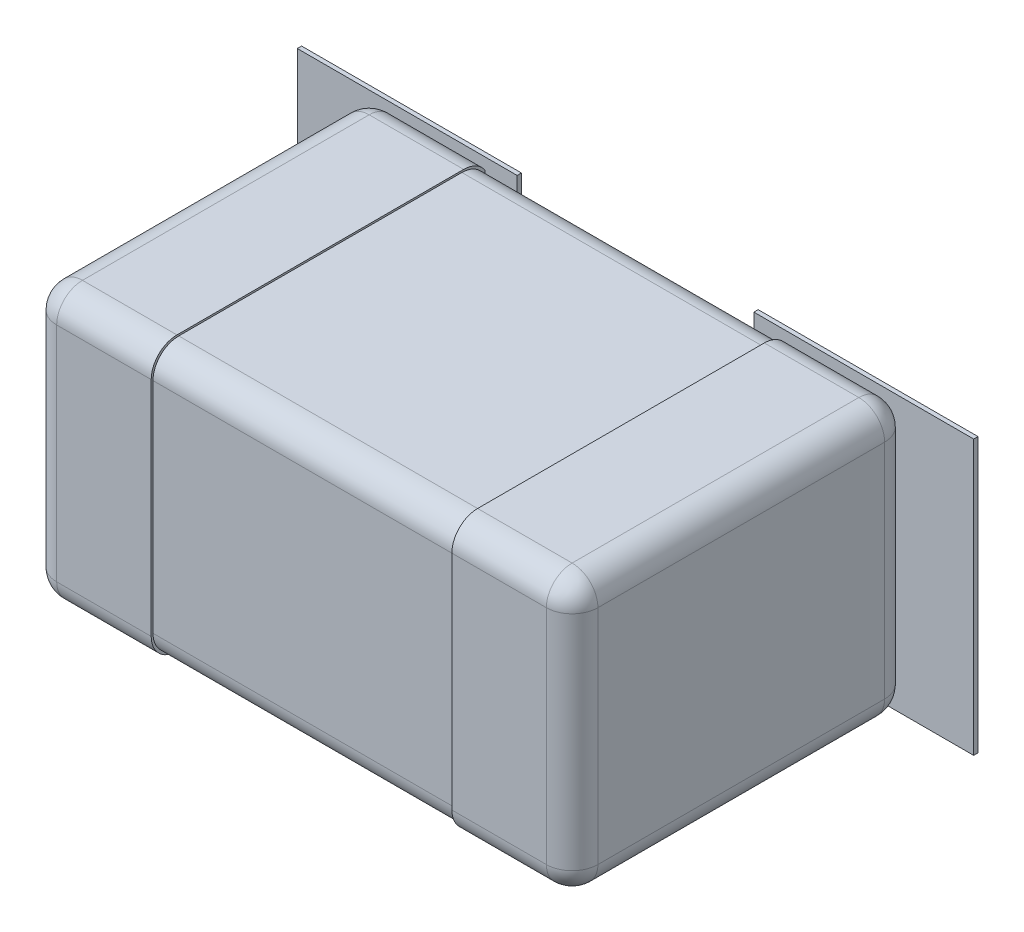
ISO-10303-21;
HEADER;
FILE_DESCRIPTION(('STEP AP214'),'2;1');
FILE_NAME('part.step','',(''),(''),'','','');
FILE_SCHEMA(('AUTOMOTIVE_DESIGN { 1 0 10303 214 1 1 1 1 }'));
ENDSEC;
DATA;
#1=APPLICATION_CONTEXT('core data for automotive mechanical design processes');
#2=APPLICATION_PROTOCOL_DEFINITION('international standard','automotive_design',2000,#1);
#3=PRODUCT_CONTEXT('',#1,'mechanical');
#4=PRODUCT('Part','Part','',(#3));
#5=PRODUCT_RELATED_PRODUCT_CATEGORY('part','',(#4));
#6=PRODUCT_DEFINITION_FORMATION('','',#4);
#7=PRODUCT_DEFINITION_CONTEXT('part definition',#1,'design');
#8=PRODUCT_DEFINITION('design','',#6,#7);
#9=PRODUCT_DEFINITION_SHAPE('','',#8);
#10=(LENGTH_UNIT() NAMED_UNIT(*) SI_UNIT(.MILLI.,.METRE.));
#11=(NAMED_UNIT(*) PLANE_ANGLE_UNIT() SI_UNIT($,.RADIAN.));
#12=(NAMED_UNIT(*) SI_UNIT($,.STERADIAN.) SOLID_ANGLE_UNIT());
#13=UNCERTAINTY_MEASURE_WITH_UNIT(LENGTH_MEASURE(1.E-05),#10,'distance_accuracy_value','');
#14=(GEOMETRIC_REPRESENTATION_CONTEXT(3) GLOBAL_UNCERTAINTY_ASSIGNED_CONTEXT((#13)) GLOBAL_UNIT_ASSIGNED_CONTEXT((#10,
#11,#12)) REPRESENTATION_CONTEXT('',''));
#15=CARTESIAN_POINT('',(0.,0.,0.));
#16=DIRECTION('',(0.,0.,1.));
#17=DIRECTION('',(1.,0.,0.));
#18=AXIS2_PLACEMENT_3D('',#15,#16,#17);
#19=CARTESIAN_POINT('',(0.800000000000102,-0.404999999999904,0.0762));
#20=DIRECTION('',(1.,0.,0.));
#21=DIRECTION('',(0.,0.,-1.));
#22=AXIS2_PLACEMENT_3D('',#19,#20,#21);
#23=PLANE('',#22);
#24=DIRECTION('',(0.,0.,-1.));
#25=VECTOR('',#24,1.);
#26=CARTESIAN_POINT('',(0.800000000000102,0.328799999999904,2.3797953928));
#27=LINE('',#26,#25);
#28=CARTESIAN_POINT('',(0.800000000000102,0.328799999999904,0.999998));
#29=VERTEX_POINT('',#28);
#30=CARTESIAN_POINT('',(0.800000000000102,0.328799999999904,0.152399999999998));
#31=VERTEX_POINT('',#30);
#32=EDGE_CURVE('E149',#29,#31,#27,.T.);
#33=ORIENTED_EDGE('',*,*,#32,.F.);
#34=DIRECTION('',(0.,1.,0.));
#35=VECTOR('',#34,1.);
#36=CARTESIAN_POINT('',(0.800000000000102,-1.4609268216,0.999998));
#37=LINE('',#36,#35);
#38=CARTESIAN_POINT('',(0.800000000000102,-0.328799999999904,0.999998));
#39=VERTEX_POINT('',#38);
#40=EDGE_CURVE('E175',#39,#29,#37,.T.);
#41=ORIENTED_EDGE('',*,*,#40,.F.);
#42=DIRECTION('',(0.,0.,-1.));
#43=VECTOR('',#42,1.);
#44=CARTESIAN_POINT('',(0.800000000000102,-0.328799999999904,2.3797953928));
#45=LINE('',#44,#43);
#46=CARTESIAN_POINT('',(0.800000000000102,-0.328799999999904,0.1524));
#47=VERTEX_POINT('',#46);
#48=EDGE_CURVE('E157',#47,#39,#45,.F.);
#49=ORIENTED_EDGE('',*,*,#48,.F.);
#50=DIRECTION('',(0.,-1.,0.));
#51=VECTOR('',#50,1.);
#52=CARTESIAN_POINT('',(0.800000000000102,1.4609268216,0.1524));
#53=LINE('',#52,#51);
#54=EDGE_CURVE('E162',#31,#47,#53,.T.);
#55=ORIENTED_EDGE('',*,*,#54,.F.);
#56=EDGE_LOOP('',(#33,#41,#49,#55));
#57=FACE_BOUND('',#56,.T.);
#58=ADVANCED_FACE('F16',(#57),#23,.T.);
#59=CARTESIAN_POINT('',(-0.800000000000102,0.404999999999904,0.0762));
#60=DIRECTION('',(-1.,0.,0.));
#61=DIRECTION('',(0.,0.,1.));
#62=AXIS2_PLACEMENT_3D('',#59,#60,#61);
#63=PLANE('',#62);
#64=DIRECTION('',(0.,0.,-1.));
#65=VECTOR('',#64,1.);
#66=CARTESIAN_POINT('',(-0.800000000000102,0.328799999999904,2.3797953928));
#67=LINE('',#66,#65);
#68=CARTESIAN_POINT('',(-0.800000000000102,0.328799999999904,0.1524));
#69=VERTEX_POINT('',#68);
#70=CARTESIAN_POINT('',(-0.800000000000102,0.328799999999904,0.999998));
#71=VERTEX_POINT('',#70);
#72=EDGE_CURVE('E146',#69,#71,#67,.F.);
#73=ORIENTED_EDGE('',*,*,#72,.F.);
#74=DIRECTION('',(0.,1.,0.));
#75=VECTOR('',#74,1.);
#76=CARTESIAN_POINT('',(-0.800000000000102,-1.4609268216,0.1524));
#77=LINE('',#76,#75);
#78=CARTESIAN_POINT('',(-0.800000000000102,-0.328799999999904,0.1524));
#79=VERTEX_POINT('',#78);
#80=EDGE_CURVE('E151',#79,#69,#77,.T.);
#81=ORIENTED_EDGE('',*,*,#80,.F.);
#82=DIRECTION('',(0.,0.,-1.));
#83=VECTOR('',#82,1.);
#84=CARTESIAN_POINT('',(-0.800000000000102,-0.328799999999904,2.3797953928));
#85=LINE('',#84,#83);
#86=CARTESIAN_POINT('',(-0.800000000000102,-0.328799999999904,0.999998));
#87=VERTEX_POINT('',#86);
#88=EDGE_CURVE('E113',#87,#79,#85,.T.);
#89=ORIENTED_EDGE('',*,*,#88,.F.);
#90=DIRECTION('',(0.,-1.,0.));
#91=VECTOR('',#90,1.);
#92=CARTESIAN_POINT('',(-0.800000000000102,1.4609268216,0.999998));
#93=LINE('',#92,#91);
#94=EDGE_CURVE('E132',#71,#87,#93,.T.);
#95=ORIENTED_EDGE('',*,*,#94,.F.);
#96=EDGE_LOOP('',(#73,#81,#89,#95));
#97=FACE_BOUND('',#96,.T.);
#98=ADVANCED_FACE('F466',(#97),#63,.T.);
#99=CARTESIAN_POINT('',(-0.723800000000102,-0.328799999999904,2.3797953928));
#100=DIRECTION('',(0.,0.,-1.));
#101=DIRECTION('',(-1.,0.,0.));
#102=AXIS2_PLACEMENT_3D('',#99,#100,#101);
#103=CYLINDRICAL_SURFACE('',#102,0.0762);
#104=CARTESIAN_POINT('',(-0.723800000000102,-0.328799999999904,0.1524));
#105=DIRECTION('',(0.,0.,-1.));
#106=DIRECTION('',(-1.,0.,0.));
#107=AXIS2_PLACEMENT_3D('',#104,#105,#106);
#108=CIRCLE('',#107,0.0762);
#109=CARTESIAN_POINT('',(-0.723800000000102,-0.404999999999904,0.1524));
#110=VERTEX_POINT('',#109);
#111=EDGE_CURVE('E665',#110,#79,#108,.T.);
#112=ORIENTED_EDGE('',*,*,#111,.F.);
#113=DIRECTION('',(0.,0.,-1.));
#114=VECTOR('',#113,1.);
#115=CARTESIAN_POINT('',(-0.723800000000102,-0.404999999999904,0.0762));
#116=LINE('',#115,#114);
#117=CARTESIAN_POINT('',(-0.723800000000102,-0.404999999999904,0.999997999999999));
#118=VERTEX_POINT('',#117);
#119=EDGE_CURVE('E130',#118,#110,#116,.T.);
#120=ORIENTED_EDGE('',*,*,#119,.F.);
#121=CARTESIAN_POINT('',(-0.723800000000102,-0.328799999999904,0.999998));
#122=DIRECTION('',(0.,0.,1.));
#123=DIRECTION('',(-0.707106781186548,-0.707106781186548,0.));
#124=AXIS2_PLACEMENT_3D('',#121,#122,#123);
#125=CIRCLE('',#124,0.0762);
#126=CARTESIAN_POINT('',(-0.777681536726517,-0.382681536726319,0.999998));
#127=VERTEX_POINT('',#126);
#128=EDGE_CURVE('E123',#127,#118,#125,.T.);
#129=ORIENTED_EDGE('',*,*,#128,.F.);
#130=CARTESIAN_POINT('',(-0.723800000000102,-0.328799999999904,0.999998));
#131=DIRECTION('',(0.,0.,-1.));
#132=DIRECTION('',(-1.,0.,0.));
#133=AXIS2_PLACEMENT_3D('',#130,#131,#132);
#134=CIRCLE('',#133,0.0762);
#135=EDGE_CURVE('E19',#87,#127,#134,.F.);
#136=ORIENTED_EDGE('',*,*,#135,.F.);
#137=ORIENTED_EDGE('',*,*,#88,.T.);
#138=EDGE_LOOP('',(#112,#120,#129,#136,#137));
#139=FACE_BOUND('',#138,.T.);
#140=ADVANCED_FACE('F128',(#139),#103,.T.);
#141=CARTESIAN_POINT('',(-0.723800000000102,-0.328799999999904,0.999998));
#142=DIRECTION('',(-0.707106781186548,-0.707106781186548,0.));
#143=DIRECTION('',(0.,0.,1.));
#144=AXIS2_PLACEMENT_3D('',#141,#142,#143);
#145=SPHERICAL_SURFACE('',#144,0.0762);
#146=ORIENTED_EDGE('',*,*,#135,.T.);
#147=ORIENTED_EDGE('',*,*,#128,.T.);
#148=CARTESIAN_POINT('',(-0.723800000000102,-0.328799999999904,0.999998));
#149=DIRECTION('',(1.,0.,0.));
#150=DIRECTION('',(0.,0.,-1.));
#151=AXIS2_PLACEMENT_3D('',#148,#149,#150);
#152=CIRCLE('',#151,0.0762);
#153=CARTESIAN_POINT('',(-0.723800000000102,-0.328799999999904,1.076198));
#154=VERTEX_POINT('',#153);
#155=EDGE_CURVE('E622',#154,#118,#152,.T.);
#156=ORIENTED_EDGE('',*,*,#155,.F.);
#157=CARTESIAN_POINT('',(-0.723800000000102,-0.328799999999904,0.999998));
#158=DIRECTION('',(0.,-1.,0.));
#159=DIRECTION('',(0.,0.,-1.));
#160=AXIS2_PLACEMENT_3D('',#157,#158,#159);
#161=CIRCLE('',#160,0.0762);
#162=EDGE_CURVE('E125',#87,#154,#161,.F.);
#163=ORIENTED_EDGE('',*,*,#162,.F.);
#164=EDGE_LOOP('',(#146,#147,#156,#163));
#165=FACE_BOUND('',#164,.T.);
#166=ADVANCED_FACE('F121',(#165),#145,.T.);
#167=CARTESIAN_POINT('',(-0.723800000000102,1.4609268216,0.999998));
#168=DIRECTION('',(0.,-1.,0.));
#169=DIRECTION('',(0.,0.,-1.));
#170=AXIS2_PLACEMENT_3D('',#167,#168,#169);
#171=CYLINDRICAL_SURFACE('',#170,0.0762);
#172=ORIENTED_EDGE('',*,*,#162,.T.);
#173=DIRECTION('',(0.,1.,0.));
#174=VECTOR('',#173,1.);
#175=CARTESIAN_POINT('',(-0.723800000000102,0.,1.076198));
#176=LINE('',#175,#174);
#177=CARTESIAN_POINT('',(-0.723800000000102,0.328799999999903,1.076198));
#178=VERTEX_POINT('',#177);
#179=EDGE_CURVE('E445',#178,#154,#176,.F.);
#180=ORIENTED_EDGE('',*,*,#179,.F.);
#181=CARTESIAN_POINT('',(-0.723800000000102,0.328799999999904,0.999998));
#182=DIRECTION('',(0.,1.,0.));
#183=DIRECTION('',(-0.707106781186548,0.,0.707106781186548));
#184=AXIS2_PLACEMENT_3D('',#181,#182,#183);
#185=CIRCLE('',#184,0.0762);
#186=CARTESIAN_POINT('',(-0.777681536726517,0.328799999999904,1.05387953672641));
#187=VERTEX_POINT('',#186);
#188=EDGE_CURVE('E452',#187,#178,#185,.T.);
#189=ORIENTED_EDGE('',*,*,#188,.F.);
#190=CARTESIAN_POINT('',(-0.723800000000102,0.328799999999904,0.999998));
#191=DIRECTION('',(0.,-1.,0.));
#192=DIRECTION('',(0.,0.,-1.));
#193=AXIS2_PLACEMENT_3D('',#190,#191,#192);
#194=CIRCLE('',#193,0.0762);
#195=EDGE_CURVE('E919',#71,#187,#194,.F.);
#196=ORIENTED_EDGE('',*,*,#195,.F.);
#197=ORIENTED_EDGE('',*,*,#94,.T.);
#198=EDGE_LOOP('',(#172,#180,#189,#196,#197));
#199=FACE_BOUND('',#198,.T.);
#200=ADVANCED_FACE('F458',(#199),#171,.T.);
#201=CARTESIAN_POINT('',(-0.723800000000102,0.328799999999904,0.999998));
#202=DIRECTION('',(-0.707106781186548,0.,0.707106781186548));
#203=DIRECTION('',(0.,1.,0.));
#204=AXIS2_PLACEMENT_3D('',#201,#202,#203);
#205=SPHERICAL_SURFACE('',#204,0.0762);
#206=ORIENTED_EDGE('',*,*,#195,.T.);
#207=ORIENTED_EDGE('',*,*,#188,.T.);
#208=CARTESIAN_POINT('',(-0.723800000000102,0.328799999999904,0.999998));
#209=DIRECTION('',(-1.,0.,0.));
#210=DIRECTION('',(0.,0.,1.));
#211=AXIS2_PLACEMENT_3D('',#208,#209,#210);
#212=CIRCLE('',#211,0.0762);
#213=CARTESIAN_POINT('',(-0.723800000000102,0.404999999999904,0.999998));
#214=VERTEX_POINT('',#213);
#215=EDGE_CURVE('E617',#214,#178,#212,.F.);
#216=ORIENTED_EDGE('',*,*,#215,.F.);
#217=CARTESIAN_POINT('',(-0.723800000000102,0.328799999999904,0.999998));
#218=DIRECTION('',(0.,0.,-1.));
#219=DIRECTION('',(-1.,0.,0.));
#220=AXIS2_PLACEMENT_3D('',#217,#218,#219);
#221=CIRCLE('',#220,0.0762);
#222=EDGE_CURVE('E150',#71,#214,#221,.T.);
#223=ORIENTED_EDGE('',*,*,#222,.F.);
#224=EDGE_LOOP('',(#206,#207,#216,#223));
#225=FACE_BOUND('',#224,.T.);
#226=ADVANCED_FACE('F454',(#225),#205,.T.);
#227=CARTESIAN_POINT('',(-0.723800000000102,0.328799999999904,2.3797953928));
#228=DIRECTION('',(0.,0.,-1.));
#229=DIRECTION('',(-1.,0.,0.));
#230=AXIS2_PLACEMENT_3D('',#227,#228,#229);
#231=CYLINDRICAL_SURFACE('',#230,0.0762);
#232=CARTESIAN_POINT('',(-0.723800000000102,0.328799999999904,0.1524));
#233=DIRECTION('',(0.,0.,-1.));
#234=DIRECTION('',(-1.,0.,0.));
#235=AXIS2_PLACEMENT_3D('',#232,#233,#234);
#236=CIRCLE('',#235,0.0762);
#237=CARTESIAN_POINT('',(-0.777681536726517,0.382681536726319,0.1524));
#238=VERTEX_POINT('',#237);
#239=EDGE_CURVE('E663',#69,#238,#236,.T.);
#240=ORIENTED_EDGE('',*,*,#239,.F.);
#241=ORIENTED_EDGE('',*,*,#72,.T.);
#242=ORIENTED_EDGE('',*,*,#222,.T.);
#243=DIRECTION('',(0.,0.,1.));
#244=VECTOR('',#243,1.);
#245=CARTESIAN_POINT('',(-0.723800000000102,0.404999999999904,0.0762));
#246=LINE('',#245,#244);
#247=CARTESIAN_POINT('',(-0.723800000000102,0.404999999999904,0.1524));
#248=VERTEX_POINT('',#247);
#249=EDGE_CURVE('E440',#248,#214,#246,.T.);
#250=ORIENTED_EDGE('',*,*,#249,.F.);
#251=CARTESIAN_POINT('',(-0.723800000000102,0.328799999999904,0.1524));
#252=DIRECTION('',(0.,0.,-1.));
#253=DIRECTION('',(-0.707106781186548,0.707106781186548,0.));
#254=AXIS2_PLACEMENT_3D('',#251,#252,#253);
#255=CIRCLE('',#254,0.0762);
#256=EDGE_CURVE('E387',#238,#248,#255,.T.);
#257=ORIENTED_EDGE('',*,*,#256,.F.);
#258=EDGE_LOOP('',(#240,#241,#242,#250,#257));
#259=FACE_BOUND('',#258,.T.);
#260=ADVANCED_FACE('F457',(#259),#231,.T.);
#261=CARTESIAN_POINT('',(0.723800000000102,0.328799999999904,2.3797953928));
#262=DIRECTION('',(0.,0.,-1.));
#263=DIRECTION('',(-1.,0.,0.));
#264=AXIS2_PLACEMENT_3D('',#261,#262,#263);
#265=CYLINDRICAL_SURFACE('',#264,0.0762);
#266=CARTESIAN_POINT('',(0.723800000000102,0.328799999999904,0.1524));
#267=DIRECTION('',(0.,0.,-1.));
#268=DIRECTION('',(-1.,0.,0.));
#269=AXIS2_PLACEMENT_3D('',#266,#267,#268);
#270=CIRCLE('',#269,0.0762);
#271=CARTESIAN_POINT('',(0.723800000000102,0.404999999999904,0.1524));
#272=VERTEX_POINT('',#271);
#273=CARTESIAN_POINT('',(0.777681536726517,0.382681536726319,0.1524));
#274=VERTEX_POINT('',#273);
#275=EDGE_CURVE('E324',#272,#274,#270,.T.);
#276=ORIENTED_EDGE('',*,*,#275,.F.);
#277=DIRECTION('',(0.,0.,1.));
#278=VECTOR('',#277,1.);
#279=CARTESIAN_POINT('',(0.723800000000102,0.404999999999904,0.0762));
#280=LINE('',#279,#278);
#281=CARTESIAN_POINT('',(0.723800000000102,0.404999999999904,0.999998));
#282=VERTEX_POINT('',#281);
#283=EDGE_CURVE('E439',#282,#272,#280,.F.);
#284=ORIENTED_EDGE('',*,*,#283,.F.);
#285=CARTESIAN_POINT('',(0.723800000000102,0.328799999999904,0.999998));
#286=DIRECTION('',(0.,0.,-1.));
#287=DIRECTION('',(-1.,0.,0.));
#288=AXIS2_PLACEMENT_3D('',#285,#286,#287);
#289=CIRCLE('',#288,0.0762);
#290=EDGE_CURVE('E167',#29,#282,#289,.F.);
#291=ORIENTED_EDGE('',*,*,#290,.F.);
#292=ORIENTED_EDGE('',*,*,#32,.T.);
#293=CARTESIAN_POINT('',(0.723800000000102,0.328799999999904,0.1524));
#294=DIRECTION('',(0.,0.,-1.));
#295=DIRECTION('',(0.707106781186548,0.707106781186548,0.));
#296=AXIS2_PLACEMENT_3D('',#293,#294,#295);
#297=CIRCLE('',#296,0.0762);
#298=EDGE_CURVE('E321',#274,#31,#297,.T.);
#299=ORIENTED_EDGE('',*,*,#298,.F.);
#300=EDGE_LOOP('',(#276,#284,#291,#292,#299));
#301=FACE_BOUND('',#300,.T.);
#302=ADVANCED_FACE('F433',(#301),#265,.T.);
#303=CARTESIAN_POINT('',(0.723800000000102,0.328799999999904,0.999998));
#304=DIRECTION('',(0.,0.707106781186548,0.707106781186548));
#305=DIRECTION('',(1.,0.,0.));
#306=AXIS2_PLACEMENT_3D('',#303,#304,#305);
#307=SPHERICAL_SURFACE('',#306,0.0762);
#308=CARTESIAN_POINT('',(0.723800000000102,0.328799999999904,0.999998));
#309=DIRECTION('',(0.,1.,0.));
#310=DIRECTION('',(0.,0.,1.));
#311=AXIS2_PLACEMENT_3D('',#308,#309,#310);
#312=CIRCLE('',#311,0.0762);
#313=CARTESIAN_POINT('',(0.723800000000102,0.328799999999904,1.076198));
#314=VERTEX_POINT('',#313);
#315=EDGE_CURVE('E178',#29,#314,#312,.F.);
#316=ORIENTED_EDGE('',*,*,#315,.F.);
#317=ORIENTED_EDGE('',*,*,#290,.T.);
#318=CARTESIAN_POINT('',(0.723800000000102,0.328799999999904,0.999998));
#319=DIRECTION('',(-1.,0.,0.));
#320=DIRECTION('',(0.,0.,1.));
#321=AXIS2_PLACEMENT_3D('',#318,#319,#320);
#322=CIRCLE('',#321,0.0762);
#323=CARTESIAN_POINT('',(0.723800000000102,0.382681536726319,1.05387953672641));
#324=VERTEX_POINT('',#323);
#325=EDGE_CURVE('E588',#324,#282,#322,.T.);
#326=ORIENTED_EDGE('',*,*,#325,.F.);
#327=CARTESIAN_POINT('',(0.723800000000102,0.328799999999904,0.999998));
#328=DIRECTION('',(-1.,0.,0.));
#329=DIRECTION('',(0.,0.,1.));
#330=AXIS2_PLACEMENT_3D('',#327,#328,#329);
#331=CIRCLE('',#330,0.0762);
#332=EDGE_CURVE('E592',#314,#324,#331,.T.);
#333=ORIENTED_EDGE('',*,*,#332,.F.);
#334=EDGE_LOOP('',(#316,#317,#326,#333));
#335=FACE_BOUND('',#334,.T.);
#336=ADVANCED_FACE('F428',(#335),#307,.T.);
#337=CARTESIAN_POINT('',(0.723800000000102,-1.4609268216,0.999998));
#338=DIRECTION('',(0.,1.,0.));
#339=DIRECTION('',(0.,0.,1.));
#340=AXIS2_PLACEMENT_3D('',#337,#338,#339);
#341=CYLINDRICAL_SURFACE('',#340,0.0762);
#342=CARTESIAN_POINT('',(0.723800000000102,-0.328799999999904,0.999998));
#343=DIRECTION('',(0.,1.,0.));
#344=DIRECTION('',(0.,0.,1.));
#345=AXIS2_PLACEMENT_3D('',#342,#343,#344);
#346=CIRCLE('',#345,0.0762);
#347=CARTESIAN_POINT('',(0.777681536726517,-0.328799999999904,1.05387953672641));
#348=VERTEX_POINT('',#347);
#349=EDGE_CURVE('E177',#39,#348,#346,.F.);
#350=ORIENTED_EDGE('',*,*,#349,.F.);
#351=ORIENTED_EDGE('',*,*,#40,.T.);
#352=ORIENTED_EDGE('',*,*,#315,.T.);
#353=DIRECTION('',(0.,1.,0.));
#354=VECTOR('',#353,1.);
#355=CARTESIAN_POINT('',(0.723800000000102,0.,1.076198));
#356=LINE('',#355,#354);
#357=CARTESIAN_POINT('',(0.723800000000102,-0.328799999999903,1.076198));
#358=VERTEX_POINT('',#357);
#359=EDGE_CURVE('E408',#358,#314,#356,.T.);
#360=ORIENTED_EDGE('',*,*,#359,.F.);
#361=CARTESIAN_POINT('',(0.723800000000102,-0.328799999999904,0.999998));
#362=DIRECTION('',(0.,-1.,0.));
#363=DIRECTION('',(0.707106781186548,0.,0.707106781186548));
#364=AXIS2_PLACEMENT_3D('',#361,#362,#363);
#365=CIRCLE('',#364,0.0762);
#366=EDGE_CURVE('E415',#348,#358,#365,.T.);
#367=ORIENTED_EDGE('',*,*,#366,.F.);
#368=EDGE_LOOP('',(#350,#351,#352,#360,#367));
#369=FACE_BOUND('',#368,.T.);
#370=ADVANCED_FACE('F423',(#369),#341,.T.);
#371=CARTESIAN_POINT('',(0.723800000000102,-0.328799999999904,0.999998));
#372=DIRECTION('',(0.707106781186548,0.,0.707106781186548));
#373=DIRECTION('',(0.,-1.,0.));
#374=AXIS2_PLACEMENT_3D('',#371,#372,#373);
#375=SPHERICAL_SURFACE('',#374,0.0762);
#376=ORIENTED_EDGE('',*,*,#366,.T.);
#377=CARTESIAN_POINT('',(0.723800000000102,-0.328799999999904,0.999998));
#378=DIRECTION('',(1.,0.,0.));
#379=DIRECTION('',(0.,0.,-1.));
#380=AXIS2_PLACEMENT_3D('',#377,#378,#379);
#381=CIRCLE('',#380,0.0762);
#382=CARTESIAN_POINT('',(0.723800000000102,-0.404999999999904,0.999998));
#383=VERTEX_POINT('',#382);
#384=EDGE_CURVE('E411',#383,#358,#381,.F.);
#385=ORIENTED_EDGE('',*,*,#384,.F.);
#386=CARTESIAN_POINT('',(0.723800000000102,-0.328799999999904,0.999998));
#387=DIRECTION('',(0.,0.,-1.));
#388=DIRECTION('',(-1.,0.,0.));
#389=AXIS2_PLACEMENT_3D('',#386,#387,#388);
#390=CIRCLE('',#389,0.0762);
#391=EDGE_CURVE('E161',#39,#383,#390,.T.);
#392=ORIENTED_EDGE('',*,*,#391,.F.);
#393=ORIENTED_EDGE('',*,*,#349,.T.);
#394=EDGE_LOOP('',(#376,#385,#392,#393));
#395=FACE_BOUND('',#394,.T.);
#396=ADVANCED_FACE('F418',(#395),#375,.T.);
#397=CARTESIAN_POINT('',(0.723800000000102,-0.328799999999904,2.3797953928));
#398=DIRECTION('',(0.,0.,-1.));
#399=DIRECTION('',(-1.,0.,0.));
#400=AXIS2_PLACEMENT_3D('',#397,#398,#399);
#401=CYLINDRICAL_SURFACE('',#400,0.0762);
#402=CARTESIAN_POINT('',(0.723800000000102,-0.328799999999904,0.1524));
#403=DIRECTION('',(0.,0.,-1.));
#404=DIRECTION('',(-1.,0.,0.));
#405=AXIS2_PLACEMENT_3D('',#402,#403,#404);
#406=CIRCLE('',#405,0.0762);
#407=CARTESIAN_POINT('',(0.777681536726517,-0.382681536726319,0.1524));
#408=VERTEX_POINT('',#407);
#409=EDGE_CURVE('E908',#47,#408,#406,.T.);
#410=ORIENTED_EDGE('',*,*,#409,.F.);
#411=ORIENTED_EDGE('',*,*,#48,.T.);
#412=ORIENTED_EDGE('',*,*,#391,.T.);
#413=DIRECTION('',(0.,0.,-1.));
#414=VECTOR('',#413,1.);
#415=CARTESIAN_POINT('',(0.723800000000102,-0.404999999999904,0.0762));
#416=LINE('',#415,#414);
#417=CARTESIAN_POINT('',(0.723800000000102,-0.404999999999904,0.1524));
#418=VERTEX_POINT('',#417);
#419=EDGE_CURVE('E403',#418,#383,#416,.F.);
#420=ORIENTED_EDGE('',*,*,#419,.F.);
#421=CARTESIAN_POINT('',(0.723800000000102,-0.328799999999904,0.1524));
#422=DIRECTION('',(0.,0.,-1.));
#423=DIRECTION('',(0.707106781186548,-0.707106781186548,0.));
#424=AXIS2_PLACEMENT_3D('',#421,#422,#423);
#425=CIRCLE('',#424,0.0762);
#426=EDGE_CURVE('E319',#408,#418,#425,.T.);
#427=ORIENTED_EDGE('',*,*,#426,.F.);
#428=EDGE_LOOP('',(#410,#411,#412,#420,#427));
#429=FACE_BOUND('',#428,.T.);
#430=ADVANCED_FACE('F422',(#429),#401,.T.);
#431=CARTESIAN_POINT('',(0.,0.,0.0762));
#432=DIRECTION('',(0.,0.,1.));
#433=DIRECTION('',(1.,0.,0.));
#434=AXIS2_PLACEMENT_3D('',#431,#432,#433);
#435=PLANE('',#434);
#436=DIRECTION('',(1.,0.,0.));
#437=VECTOR('',#436,1.);
#438=CARTESIAN_POINT('',(-0.999871,-0.405003,0.0762));
#439=LINE('',#438,#437);
#440=CARTESIAN_POINT('',(-0.999871,-0.405003,0.0762));
#441=VERTEX_POINT('',#440);
#442=CARTESIAN_POINT('',(-0.349885,-0.405003,0.0762));
#443=VERTEX_POINT('',#442);
#444=EDGE_CURVE('E397',#441,#443,#439,.T.);
#445=ORIENTED_EDGE('',*,*,#444,.F.);
#446=DIRECTION('',(0.,1.,0.));
#447=VECTOR('',#446,1.);
#448=CARTESIAN_POINT('',(-0.999871,0.405003,0.0762));
#449=LINE('',#448,#447);
#450=CARTESIAN_POINT('',(-0.999871,0.405003,0.0762));
#451=VERTEX_POINT('',#450);
#452=EDGE_CURVE('E139',#451,#441,#449,.F.);
#453=ORIENTED_EDGE('',*,*,#452,.F.);
#454=DIRECTION('',(1.,0.,0.));
#455=VECTOR('',#454,1.);
#456=CARTESIAN_POINT('',(-0.349885,0.405003,0.0762));
#457=LINE('',#456,#455);
#458=CARTESIAN_POINT('',(-0.349885,0.405003,0.0762));
#459=VERTEX_POINT('',#458);
#460=EDGE_CURVE('E384',#459,#451,#457,.F.);
#461=ORIENTED_EDGE('',*,*,#460,.F.);
#462=DIRECTION('',(0.,1.,0.));
#463=VECTOR('',#462,1.);
#464=CARTESIAN_POINT('',(-0.349885,-0.405003,0.0762));
#465=LINE('',#464,#463);
#466=EDGE_CURVE('E390',#443,#459,#465,.T.);
#467=ORIENTED_EDGE('',*,*,#466,.F.);
#468=EDGE_LOOP('',(#445,#453,#461,#467));
#469=FACE_BOUND('',#468,.T.);
#470=ADVANCED_FACE('F976',(#469),#435,.F.);
#471=CARTESIAN_POINT('',(0.,0.,0.0762));
#472=DIRECTION('',(0.,0.,1.));
#473=DIRECTION('',(1.,0.,0.));
#474=AXIS2_PLACEMENT_3D('',#471,#472,#473);
#475=PLANE('',#474);
#476=DIRECTION('',(1.,0.,0.));
#477=VECTOR('',#476,1.);
#478=CARTESIAN_POINT('',(0.349885,-0.405003,0.0762));
#479=LINE('',#478,#477);
#480=CARTESIAN_POINT('',(0.349885,-0.405003,0.0762));
#481=VERTEX_POINT('',#480);
#482=CARTESIAN_POINT('',(0.999871,-0.405003,0.0762));
#483=VERTEX_POINT('',#482);
#484=EDGE_CURVE('E160',#481,#483,#479,.T.);
#485=ORIENTED_EDGE('',*,*,#484,.F.);
#486=DIRECTION('',(0.,1.,0.));
#487=VECTOR('',#486,1.);
#488=CARTESIAN_POINT('',(0.349885,0.405003,0.0762));
#489=LINE('',#488,#487);
#490=CARTESIAN_POINT('',(0.349885,0.405003,0.0762));
#491=VERTEX_POINT('',#490);
#492=EDGE_CURVE('E335',#491,#481,#489,.F.);
#493=ORIENTED_EDGE('',*,*,#492,.F.);
#494=DIRECTION('',(1.,0.,0.));
#495=VECTOR('',#494,1.);
#496=CARTESIAN_POINT('',(0.999871,0.405003,0.0762));
#497=LINE('',#496,#495);
#498=CARTESIAN_POINT('',(0.999871,0.405003,0.0762));
#499=VERTEX_POINT('',#498);
#500=EDGE_CURVE('E345',#499,#491,#497,.F.);
#501=ORIENTED_EDGE('',*,*,#500,.F.);
#502=DIRECTION('',(0.,1.,0.));
#503=VECTOR('',#502,1.);
#504=CARTESIAN_POINT('',(0.999871,-0.405003,0.0762));
#505=LINE('',#504,#503);
#506=EDGE_CURVE('E168',#483,#499,#505,.T.);
#507=ORIENTED_EDGE('',*,*,#506,.F.);
#508=EDGE_LOOP('',(#485,#493,#501,#507));
#509=FACE_BOUND('',#508,.T.);
#510=ADVANCED_FACE('F980',(#509),#475,.F.);
#511=CARTESIAN_POINT('',(0.349885,-0.405003,0.0762));
#512=DIRECTION('',(0.,-1.,0.));
#513=DIRECTION('',(0.,0.,-1.));
#514=AXIS2_PLACEMENT_3D('',#511,#512,#513);
#515=PLANE('',#514);
#516=DIRECTION('',(0.,0.,1.));
#517=VECTOR('',#516,1.);
#518=CARTESIAN_POINT('',(0.349885,-0.405003,0.0762));
#519=LINE('',#518,#517);
#520=CARTESIAN_POINT('',(0.349885,-0.405003,0.0889));
#521=VERTEX_POINT('',#520);
#522=EDGE_CURVE('E362',#481,#521,#519,.T.);
#523=ORIENTED_EDGE('',*,*,#522,.F.);
#524=ORIENTED_EDGE('',*,*,#484,.T.);
#525=DIRECTION('',(0.,0.,-1.));
#526=VECTOR('',#525,1.);
#527=CARTESIAN_POINT('',(0.999871,-0.405003,0.0762));
#528=LINE('',#527,#526);
#529=CARTESIAN_POINT('',(0.999871,-0.405003,0.0889));
#530=VERTEX_POINT('',#529);
#531=EDGE_CURVE('E172',#530,#483,#528,.T.);
#532=ORIENTED_EDGE('',*,*,#531,.F.);
#533=DIRECTION('',(1.,0.,0.));
#534=VECTOR('',#533,1.);
#535=CARTESIAN_POINT('',(0.,-0.405003,0.0889));
#536=LINE('',#535,#534);
#537=EDGE_CURVE('E350',#521,#530,#536,.T.);
#538=ORIENTED_EDGE('',*,*,#537,.F.);
#539=EDGE_LOOP('',(#523,#524,#532,#538));
#540=FACE_BOUND('',#539,.T.);
#541=ADVANCED_FACE('F985',(#540),#515,.T.);
#542=CARTESIAN_POINT('',(0.999871,-0.405003,0.0762));
#543=DIRECTION('',(1.,0.,0.));
#544=DIRECTION('',(0.,0.,-1.));
#545=AXIS2_PLACEMENT_3D('',#542,#543,#544);
#546=PLANE('',#545);
#547=ORIENTED_EDGE('',*,*,#531,.T.);
#548=ORIENTED_EDGE('',*,*,#506,.T.);
#549=DIRECTION('',(0.,0.,1.));
#550=VECTOR('',#549,1.);
#551=CARTESIAN_POINT('',(0.999871,0.405003,0.0762));
#552=LINE('',#551,#550);
#553=CARTESIAN_POINT('',(0.999871,0.405003,0.0889));
#554=VERTEX_POINT('',#553);
#555=EDGE_CURVE('E171',#554,#499,#552,.F.);
#556=ORIENTED_EDGE('',*,*,#555,.F.);
#557=DIRECTION('',(0.,1.,0.));
#558=VECTOR('',#557,1.);
#559=CARTESIAN_POINT('',(0.999871,0.,0.0889));
#560=LINE('',#559,#558);
#561=EDGE_CURVE('E340',#530,#554,#560,.T.);
#562=ORIENTED_EDGE('',*,*,#561,.F.);
#563=EDGE_LOOP('',(#547,#548,#556,#562));
#564=FACE_BOUND('',#563,.T.);
#565=ADVANCED_FACE('F990',(#564),#546,.T.);
#566=CARTESIAN_POINT('',(0.999871,0.405003,0.0762));
#567=DIRECTION('',(0.,1.,0.));
#568=DIRECTION('',(0.,0.,1.));
#569=AXIS2_PLACEMENT_3D('',#566,#567,#568);
#570=PLANE('',#569);
#571=ORIENTED_EDGE('',*,*,#555,.T.);
#572=ORIENTED_EDGE('',*,*,#500,.T.);
#573=DIRECTION('',(0.,0.,1.));
#574=VECTOR('',#573,1.);
#575=CARTESIAN_POINT('',(0.349885,0.405003,0.0762));
#576=LINE('',#575,#574);
#577=CARTESIAN_POINT('',(0.349885,0.405003,0.0889));
#578=VERTEX_POINT('',#577);
#579=EDGE_CURVE('E332',#578,#491,#576,.F.);
#580=ORIENTED_EDGE('',*,*,#579,.F.);
#581=DIRECTION('',(1.,0.,0.));
#582=VECTOR('',#581,1.);
#583=CARTESIAN_POINT('',(0.,0.405003,0.0889));
#584=LINE('',#583,#582);
#585=EDGE_CURVE('E329',#554,#578,#584,.F.);
#586=ORIENTED_EDGE('',*,*,#585,.F.);
#587=EDGE_LOOP('',(#571,#572,#580,#586));
#588=FACE_BOUND('',#587,.T.);
#589=ADVANCED_FACE('F313',(#588),#570,.T.);
#590=CARTESIAN_POINT('',(0.723800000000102,0.328799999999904,0.1524));
#591=DIRECTION('',(0.707106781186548,0.707106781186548,0.));
#592=DIRECTION('',(0.,0.,-1.));
#593=AXIS2_PLACEMENT_3D('',#590,#591,#592);
#594=SPHERICAL_SURFACE('',#593,0.0762);
#595=CARTESIAN_POINT('',(0.723800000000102,0.328799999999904,0.1524));
#596=DIRECTION('',(0.,-1.,0.));
#597=DIRECTION('',(0.,0.,-1.));
#598=AXIS2_PLACEMENT_3D('',#595,#596,#597);
#599=CIRCLE('',#598,0.0762);
#600=CARTESIAN_POINT('',(0.765921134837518,0.328799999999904,0.0889));
#601=VERTEX_POINT('',#600);
#602=EDGE_CURVE('E165',#601,#31,#599,.T.);
#603=ORIENTED_EDGE('',*,*,#602,.F.);
#604=CARTESIAN_POINT('',(0.723800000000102,0.370921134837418,0.0889));
#605=CARTESIAN_POINT('',(0.72854767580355,0.370952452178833,0.0888999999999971));
#606=CARTESIAN_POINT('',(0.733275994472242,0.370123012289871,0.0889000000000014));
#607=CARTESIAN_POINT('',(0.742208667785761,0.366970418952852,0.0889000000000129));
#608=CARTESIAN_POINT('',(0.746413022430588,0.364647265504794,0.0889000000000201));
#609=CARTESIAN_POINT('',(0.753812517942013,0.358735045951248,0.088900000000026));
#610=CARTESIAN_POINT('',(0.757007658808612,0.355145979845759,0.0889000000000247));
#611=CARTESIAN_POINT('',(0.762025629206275,0.34710875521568,0.0889000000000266));
#612=CARTESIAN_POINT('',(0.76384845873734,0.342660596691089,0.0889000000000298));
#613=CARTESIAN_POINT('',(0.765581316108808,0.335011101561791,0.088900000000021));
#614=CARTESIAN_POINT('',(0.765932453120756,0.331903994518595,0.0889000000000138));
#615=CARTESIAN_POINT('',(0.765921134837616,0.328799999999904,0.0889));
#616=B_SPLINE_CURVE_WITH_KNOTS('',3,(#604,#605,#606,#607,#608,#609,#610,#611,#612,#613,#614,
#615),.UNSPECIFIED.,.F.,.F.,(4,2,2,2,2,4),(0.,0.0141430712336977,0.028286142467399,
0.0424292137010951,0.0565722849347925,0.0658755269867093),.UNSPECIFIED.);
#617=CARTESIAN_POINT('',(0.723800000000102,0.370921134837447,0.0889));
#618=VERTEX_POINT('',#617);
#619=EDGE_CURVE('E296',#618,#601,#616,.T.);
#620=ORIENTED_EDGE('',*,*,#619,.F.);
#621=CARTESIAN_POINT('',(0.723800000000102,0.328799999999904,0.1524));
#622=DIRECTION('',(1.,0.,0.));
#623=DIRECTION('',(0.,0.,-1.));
#624=AXIS2_PLACEMENT_3D('',#621,#622,#623);
#625=CIRCLE('',#624,0.0762);
#626=EDGE_CURVE('E598',#272,#618,#625,.F.);
#627=ORIENTED_EDGE('',*,*,#626,.F.);
#628=ORIENTED_EDGE('',*,*,#275,.T.);
#629=ORIENTED_EDGE('',*,*,#298,.T.);
#630=EDGE_LOOP('',(#603,#620,#627,#628,#629));
#631=FACE_BOUND('',#630,.T.);
#632=ADVANCED_FACE('F306',(#631),#594,.T.);
#633=CARTESIAN_POINT('',(0.723800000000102,1.4609268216,0.1524));
#634=DIRECTION('',(0.,-1.,0.));
#635=DIRECTION('',(0.,0.,-1.));
#636=AXIS2_PLACEMENT_3D('',#633,#634,#635);
#637=CYLINDRICAL_SURFACE('',#636,0.0762);
#638=CARTESIAN_POINT('',(0.723800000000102,-0.328799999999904,0.1524));
#639=DIRECTION('',(0.,-1.,0.));
#640=DIRECTION('',(0.,0.,-1.));
#641=AXIS2_PLACEMENT_3D('',#638,#639,#640);
#642=CIRCLE('',#641,0.0762);
#643=CARTESIAN_POINT('',(0.765921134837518,-0.328799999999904,0.0889));
#644=VERTEX_POINT('',#643);
#645=EDGE_CURVE('E164',#644,#47,#642,.T.);
#646=ORIENTED_EDGE('',*,*,#645,.F.);
#647=DIRECTION('',(0.,1.,0.));
#648=VECTOR('',#647,1.);
#649=CARTESIAN_POINT('',(0.76592113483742,0.,0.0889));
#650=LINE('',#649,#648);
#651=EDGE_CURVE('E302',#601,#644,#650,.F.);
#652=ORIENTED_EDGE('',*,*,#651,.F.);
#653=ORIENTED_EDGE('',*,*,#602,.T.);
#654=ORIENTED_EDGE('',*,*,#54,.T.);
#655=EDGE_LOOP('',(#646,#652,#653,#654));
#656=FACE_BOUND('',#655,.T.);
#657=ADVANCED_FACE('F312',(#656),#637,.T.);
#658=CARTESIAN_POINT('',(0.723800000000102,-0.328799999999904,0.1524));
#659=DIRECTION('',(0.707106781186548,-0.707106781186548,0.));
#660=DIRECTION('',(0.,0.,-1.));
#661=AXIS2_PLACEMENT_3D('',#658,#659,#660);
#662=SPHERICAL_SURFACE('',#661,0.0762);
#663=CARTESIAN_POINT('',(0.723800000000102,-0.328799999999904,0.1524));
#664=DIRECTION('',(-1.,0.,0.));
#665=DIRECTION('',(0.,0.,1.));
#666=AXIS2_PLACEMENT_3D('',#663,#664,#665);
#667=CIRCLE('',#666,0.0762);
#668=CARTESIAN_POINT('',(0.723800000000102,-0.370921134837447,0.0889));
#669=VERTEX_POINT('',#668);
#670=EDGE_CURVE('E578',#669,#418,#667,.T.);
#671=ORIENTED_EDGE('',*,*,#670,.F.);
#672=CARTESIAN_POINT('',(0.765921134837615,-0.328799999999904,0.0889));
#673=CARTESIAN_POINT('',(0.765952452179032,-0.333547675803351,0.0888999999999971));
#674=CARTESIAN_POINT('',(0.765123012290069,-0.338275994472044,0.0889000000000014));
#675=CARTESIAN_POINT('',(0.76197041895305,-0.347208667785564,0.0889000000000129));
#676=CARTESIAN_POINT('',(0.759647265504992,-0.35141302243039,0.0889000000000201));
#677=CARTESIAN_POINT('',(0.753735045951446,-0.358812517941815,0.088900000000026));
#678=CARTESIAN_POINT('',(0.750145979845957,-0.362007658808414,0.0889000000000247));
#679=CARTESIAN_POINT('',(0.742108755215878,-0.367025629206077,0.0889000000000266));
#680=CARTESIAN_POINT('',(0.737660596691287,-0.368848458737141,0.0889000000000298));
#681=CARTESIAN_POINT('',(0.730011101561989,-0.37058131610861,0.088900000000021));
#682=CARTESIAN_POINT('',(0.726903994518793,-0.370932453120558,0.0889000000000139));
#683=CARTESIAN_POINT('',(0.723800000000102,-0.370921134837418,0.0889));
#684=B_SPLINE_CURVE_WITH_KNOTS('',3,(#672,#673,#674,#675,#676,#677,#678,#679,#680,#681,#682,
#683),.UNSPECIFIED.,.F.,.F.,(4,2,2,2,2,4),(0.,0.0141430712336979,0.0282861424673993,
0.0424292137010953,0.0565722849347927,0.0658755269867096),.UNSPECIFIED.);
#685=EDGE_CURVE('E290',#644,#669,#684,.T.);
#686=ORIENTED_EDGE('',*,*,#685,.F.);
#687=ORIENTED_EDGE('',*,*,#645,.T.);
#688=ORIENTED_EDGE('',*,*,#409,.T.);
#689=ORIENTED_EDGE('',*,*,#426,.T.);
#690=EDGE_LOOP('',(#671,#686,#687,#688,#689));
#691=FACE_BOUND('',#690,.T.);
#692=ADVANCED_FACE('F672',(#691),#662,.T.);
#693=CARTESIAN_POINT('',(-0.723800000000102,-0.328799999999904,0.1524));
#694=DIRECTION('',(-0.707106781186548,0.,-0.707106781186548));
#695=DIRECTION('',(0.,-1.,0.));
#696=AXIS2_PLACEMENT_3D('',#693,#694,#695);
#697=SPHERICAL_SURFACE('',#696,0.0762);
#698=CARTESIAN_POINT('',(-0.723800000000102,-0.328799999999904,0.1524));
#699=DIRECTION('',(0.,1.,0.));
#700=DIRECTION('',(0.,0.,1.));
#701=AXIS2_PLACEMENT_3D('',#698,#699,#700);
#702=CIRCLE('',#701,0.0762);
#703=CARTESIAN_POINT('',(-0.765921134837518,-0.328799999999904,0.0889));
#704=VERTEX_POINT('',#703);
#705=CARTESIAN_POINT('',(-0.777681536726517,-0.328799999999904,0.0985184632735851));
#706=VERTEX_POINT('',#705);
#707=EDGE_CURVE('E34',#704,#706,#702,.T.);
#708=ORIENTED_EDGE('',*,*,#707,.F.);
#709=CARTESIAN_POINT('',(-0.723800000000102,-0.370921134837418,0.0888999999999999));
#710=CARTESIAN_POINT('',(-0.728547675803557,-0.370952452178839,0.0889000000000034));
#711=CARTESIAN_POINT('',(-0.733275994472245,-0.37012301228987,0.0889000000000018));
#712=CARTESIAN_POINT('',(-0.742208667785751,-0.366970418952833,0.0888999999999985));
#713=CARTESIAN_POINT('',(-0.746413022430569,-0.364647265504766,0.0888999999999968));
#714=CARTESIAN_POINT('',(-0.753812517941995,-0.358735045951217,0.0889000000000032));
#715=CARTESIAN_POINT('',(-0.757007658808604,-0.355145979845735,0.0889000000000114));
#716=CARTESIAN_POINT('',(-0.762025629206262,-0.347108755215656,0.0889000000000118));
#717=CARTESIAN_POINT('',(-0.76384845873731,-0.342660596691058,0.088900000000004));
#718=CARTESIAN_POINT('',(-0.765581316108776,-0.335011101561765,0.0888999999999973));
#719=CARTESIAN_POINT('',(-0.76593245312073,-0.33190399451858,0.0888999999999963));
#720=CARTESIAN_POINT('',(-0.765921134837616,-0.328799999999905,0.0889000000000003));
#721=B_SPLINE_CURVE_WITH_KNOTS('',3,(#709,#710,#711,#712,#713,#714,#715,#716,#717,#718,#719,
#720),.UNSPECIFIED.,.F.,.F.,(4,2,2,2,2,4),(0.,0.0141430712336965,0.0282861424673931,
0.0424292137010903,0.0565722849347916,0.0658755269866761),.UNSPECIFIED.);
#722=CARTESIAN_POINT('',(-0.723800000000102,-0.370921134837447,0.0889));
#723=VERTEX_POINT('',#722);
#724=EDGE_CURVE('E262',#723,#704,#721,.T.);
#725=ORIENTED_EDGE('',*,*,#724,.F.);
#726=CARTESIAN_POINT('',(-0.723800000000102,-0.328799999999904,0.1524));
#727=DIRECTION('',(-1.,0.,0.));
#728=DIRECTION('',(0.,0.,1.));
#729=AXIS2_PLACEMENT_3D('',#726,#727,#728);
#730=CIRCLE('',#729,0.0762);
#731=EDGE_CURVE('E400',#110,#723,#730,.F.);
#732=ORIENTED_EDGE('',*,*,#731,.F.);
#733=ORIENTED_EDGE('',*,*,#111,.T.);
#734=CARTESIAN_POINT('',(-0.723800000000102,-0.328799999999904,0.1524));
#735=DIRECTION('',(0.,1.,0.));
#736=DIRECTION('',(0.,0.,1.));
#737=AXIS2_PLACEMENT_3D('',#734,#735,#736);
#738=CIRCLE('',#737,0.0762);
#739=EDGE_CURVE('E155',#706,#79,#738,.T.);
#740=ORIENTED_EDGE('',*,*,#739,.F.);
#741=EDGE_LOOP('',(#708,#725,#732,#733,#740));
#742=FACE_BOUND('',#741,.T.);
#743=ADVANCED_FACE('F668',(#742),#697,.T.);
#744=CARTESIAN_POINT('',(-0.723800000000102,-1.4609268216,0.1524));
#745=DIRECTION('',(0.,1.,0.));
#746=DIRECTION('',(0.,0.,1.));
#747=AXIS2_PLACEMENT_3D('',#744,#745,#746);
#748=CYLINDRICAL_SURFACE('',#747,0.0762);
#749=CARTESIAN_POINT('',(-0.723800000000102,0.328799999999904,0.1524));
#750=DIRECTION('',(0.,1.,0.));
#751=DIRECTION('',(0.,0.,1.));
#752=AXIS2_PLACEMENT_3D('',#749,#750,#751);
#753=CIRCLE('',#752,0.0762);
#754=CARTESIAN_POINT('',(-0.765921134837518,0.328799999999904,0.0889));
#755=VERTEX_POINT('',#754);
#756=EDGE_CURVE('E154',#755,#69,#753,.T.);
#757=ORIENTED_EDGE('',*,*,#756,.F.);
#758=DIRECTION('',(0.,1.,0.));
#759=VECTOR('',#758,1.);
#760=CARTESIAN_POINT('',(-0.76592113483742,0.,0.0889));
#761=LINE('',#760,#759);
#762=EDGE_CURVE('E261',#704,#755,#761,.T.);
#763=ORIENTED_EDGE('',*,*,#762,.F.);
#764=ORIENTED_EDGE('',*,*,#707,.T.);
#765=ORIENTED_EDGE('',*,*,#739,.T.);
#766=ORIENTED_EDGE('',*,*,#80,.T.);
#767=EDGE_LOOP('',(#757,#763,#764,#765,#766));
#768=FACE_BOUND('',#767,.T.);
#769=ADVANCED_FACE('F671',(#768),#748,.T.);
#770=CARTESIAN_POINT('',(-0.723800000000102,0.328799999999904,0.1524));
#771=DIRECTION('',(-0.707106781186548,0.707106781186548,0.));
#772=DIRECTION('',(0.,0.,-1.));
#773=AXIS2_PLACEMENT_3D('',#770,#771,#772);
#774=SPHERICAL_SURFACE('',#773,0.0762);
#775=CARTESIAN_POINT('',(-0.723800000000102,0.328799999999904,0.1524));
#776=DIRECTION('',(1.,0.,0.));
#777=DIRECTION('',(0.,0.,-1.));
#778=AXIS2_PLACEMENT_3D('',#775,#776,#777);
#779=CIRCLE('',#778,0.0762);
#780=CARTESIAN_POINT('',(-0.723800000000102,0.370921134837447,0.0889));
#781=VERTEX_POINT('',#780);
#782=EDGE_CURVE('E612',#781,#248,#779,.T.);
#783=ORIENTED_EDGE('',*,*,#782,.F.);
#784=CARTESIAN_POINT('',(-0.765921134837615,0.328799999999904,0.0889));
#785=CARTESIAN_POINT('',(-0.765952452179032,0.333547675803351,0.0888999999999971));
#786=CARTESIAN_POINT('',(-0.765123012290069,0.338275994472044,0.0889000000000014));
#787=CARTESIAN_POINT('',(-0.76197041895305,0.347208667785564,0.0889000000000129));
#788=CARTESIAN_POINT('',(-0.759647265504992,0.35141302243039,0.0889000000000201));
#789=CARTESIAN_POINT('',(-0.753735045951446,0.358812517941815,0.088900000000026));
#790=CARTESIAN_POINT('',(-0.750145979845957,0.362007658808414,0.0889000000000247));
#791=CARTESIAN_POINT('',(-0.742108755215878,0.367025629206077,0.0889000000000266));
#792=CARTESIAN_POINT('',(-0.737660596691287,0.368848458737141,0.0889000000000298));
#793=CARTESIAN_POINT('',(-0.730011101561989,0.37058131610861,0.088900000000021));
#794=CARTESIAN_POINT('',(-0.726903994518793,0.370932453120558,0.0889000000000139));
#795=CARTESIAN_POINT('',(-0.723800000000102,0.370921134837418,0.0889));
#796=B_SPLINE_CURVE_WITH_KNOTS('',3,(#784,#785,#786,#787,#788,#789,#790,#791,#792,#793,#794,
#795),.UNSPECIFIED.,.F.,.F.,(4,2,2,2,2,4),(0.,0.0141430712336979,0.0282861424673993,
0.0424292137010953,0.0565722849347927,0.0658755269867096),.UNSPECIFIED.);
#797=EDGE_CURVE('E252',#755,#781,#796,.T.);
#798=ORIENTED_EDGE('',*,*,#797,.F.);
#799=ORIENTED_EDGE('',*,*,#756,.T.);
#800=ORIENTED_EDGE('',*,*,#239,.T.);
#801=ORIENTED_EDGE('',*,*,#256,.T.);
#802=EDGE_LOOP('',(#783,#798,#799,#800,#801));
#803=FACE_BOUND('',#802,.T.);
#804=ADVANCED_FACE('F268',(#803),#774,.T.);
#805=CARTESIAN_POINT('',(-0.349885,0.405003,0.0762));
#806=DIRECTION('',(0.,1.,0.));
#807=DIRECTION('',(0.,0.,1.));
#808=AXIS2_PLACEMENT_3D('',#805,#806,#807);
#809=PLANE('',#808);
#810=DIRECTION('',(0.,0.,-1.));
#811=VECTOR('',#810,1.);
#812=CARTESIAN_POINT('',(-0.349885,0.405003,0.0762));
#813=LINE('',#812,#811);
#814=CARTESIAN_POINT('',(-0.349885,0.405003,0.0889));
#815=VERTEX_POINT('',#814);
#816=EDGE_CURVE('E393',#459,#815,#813,.F.);
#817=ORIENTED_EDGE('',*,*,#816,.F.);
#818=ORIENTED_EDGE('',*,*,#460,.T.);
#819=DIRECTION('',(0.,0.,1.));
#820=VECTOR('',#819,1.);
#821=CARTESIAN_POINT('',(-0.999871,0.405003,0.0762));
#822=LINE('',#821,#820);
#823=CARTESIAN_POINT('',(-0.999871,0.405003,0.0889));
#824=VERTEX_POINT('',#823);
#825=EDGE_CURVE('E143',#824,#451,#822,.F.);
#826=ORIENTED_EDGE('',*,*,#825,.F.);
#827=DIRECTION('',(1.,0.,0.));
#828=VECTOR('',#827,1.);
#829=CARTESIAN_POINT('',(0.,0.405003,0.0889));
#830=LINE('',#829,#828);
#831=EDGE_CURVE('E641',#815,#824,#830,.F.);
#832=ORIENTED_EDGE('',*,*,#831,.F.);
#833=EDGE_LOOP('',(#817,#818,#826,#832));
#834=FACE_BOUND('',#833,.T.);
#835=ADVANCED_FACE('F873',(#834),#809,.T.);
#836=CARTESIAN_POINT('',(-0.999871,0.405003,0.0762));
#837=DIRECTION('',(-1.,0.,0.));
#838=DIRECTION('',(0.,0.,1.));
#839=AXIS2_PLACEMENT_3D('',#836,#837,#838);
#840=PLANE('',#839);
#841=ORIENTED_EDGE('',*,*,#825,.T.);
#842=ORIENTED_EDGE('',*,*,#452,.T.);
#843=DIRECTION('',(0.,0.,-1.));
#844=VECTOR('',#843,1.);
#845=CARTESIAN_POINT('',(-0.999871,-0.405003,0.0762));
#846=LINE('',#845,#844);
#847=CARTESIAN_POINT('',(-0.999871,-0.405003,0.0889));
#848=VERTEX_POINT('',#847);
#849=EDGE_CURVE('E142',#848,#441,#846,.T.);
#850=ORIENTED_EDGE('',*,*,#849,.F.);
#851=DIRECTION('',(0.,1.,0.));
#852=VECTOR('',#851,1.);
#853=CARTESIAN_POINT('',(-0.999871,0.,0.0889));
#854=LINE('',#853,#852);
#855=EDGE_CURVE('E632',#824,#848,#854,.F.);
#856=ORIENTED_EDGE('',*,*,#855,.F.);
#857=EDGE_LOOP('',(#841,#842,#850,#856));
#858=FACE_BOUND('',#857,.T.);
#859=ADVANCED_FACE('F878',(#858),#840,.T.);
#860=CARTESIAN_POINT('',(-0.999871,-0.405003,0.0762));
#861=DIRECTION('',(0.,-1.,0.));
#862=DIRECTION('',(0.,0.,-1.));
#863=AXIS2_PLACEMENT_3D('',#860,#861,#862);
#864=PLANE('',#863);
#865=ORIENTED_EDGE('',*,*,#849,.T.);
#866=ORIENTED_EDGE('',*,*,#444,.T.);
#867=DIRECTION('',(0.,0.,-1.));
#868=VECTOR('',#867,1.);
#869=CARTESIAN_POINT('',(-0.349885,-0.405003,0.0762));
#870=LINE('',#869,#868);
#871=CARTESIAN_POINT('',(-0.349885,-0.405003,0.0889));
#872=VERTEX_POINT('',#871);
#873=EDGE_CURVE('E394',#872,#443,#870,.T.);
#874=ORIENTED_EDGE('',*,*,#873,.F.);
#875=DIRECTION('',(1.,0.,0.));
#876=VECTOR('',#875,1.);
#877=CARTESIAN_POINT('',(0.,-0.405003,0.0889));
#878=LINE('',#877,#876);
#879=EDGE_CURVE('E572',#848,#872,#878,.T.);
#880=ORIENTED_EDGE('',*,*,#879,.F.);
#881=EDGE_LOOP('',(#865,#866,#874,#880));
#882=FACE_BOUND('',#881,.T.);
#883=ADVANCED_FACE('F881',(#882),#864,.T.);
#884=CARTESIAN_POINT('',(3.6067346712,-0.328799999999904,0.1524));
#885=DIRECTION('',(-1.,0.,0.));
#886=DIRECTION('',(0.,0.,1.));
#887=AXIS2_PLACEMENT_3D('',#884,#885,#886);
#888=CYLINDRICAL_SURFACE('',#887,0.0762);
#889=ORIENTED_EDGE('',*,*,#731,.T.);
#890=DIRECTION('',(1.,0.,0.));
#891=VECTOR('',#890,1.);
#892=CARTESIAN_POINT('',(0.,-0.370921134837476,0.0889));
#893=LINE('',#892,#891);
#894=CARTESIAN_POINT('',(-0.444400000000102,-0.370921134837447,0.0889));
#895=VERTEX_POINT('',#894);
#896=EDGE_CURVE('E546',#895,#723,#893,.F.);
#897=ORIENTED_EDGE('',*,*,#896,.F.);
#898=CARTESIAN_POINT('',(-0.444400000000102,-0.328799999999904,0.1524));
#899=DIRECTION('',(-1.,0.,0.));
#900=DIRECTION('',(0.,0.,1.));
#901=AXIS2_PLACEMENT_3D('',#898,#899,#900);
#902=CIRCLE('',#901,0.0762);
#903=CARTESIAN_POINT('',(-0.444400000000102,-0.404999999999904,0.1524));
#904=VERTEX_POINT('',#903);
#905=EDGE_CURVE('E248',#895,#904,#902,.T.);
#906=ORIENTED_EDGE('',*,*,#905,.T.);
#907=DIRECTION('',(1.,0.,0.));
#908=VECTOR('',#907,1.);
#909=CARTESIAN_POINT('',(-0.800000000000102,-0.404999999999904,0.1524));
#910=LINE('',#909,#908);
#911=EDGE_CURVE('E623',#110,#904,#910,.T.);
#912=ORIENTED_EDGE('',*,*,#911,.F.);
#913=EDGE_LOOP('',(#889,#897,#906,#912));
#914=FACE_BOUND('',#913,.T.);
#915=ADVANCED_FACE('F890',(#914),#888,.T.);
#916=CARTESIAN_POINT('',(-0.800000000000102,-0.404999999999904,0.0762));
#917=DIRECTION('',(0.,-1.,0.));
#918=DIRECTION('',(0.,0.,-1.));
#919=AXIS2_PLACEMENT_3D('',#916,#917,#918);
#920=PLANE('',#919);
#921=DIRECTION('',(0.,0.,1.));
#922=VECTOR('',#921,1.);
#923=CARTESIAN_POINT('',(-0.444400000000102,-0.404999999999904,0.0762));
#924=LINE('',#923,#922);
#925=CARTESIAN_POINT('',(-0.444400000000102,-0.404999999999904,0.999998));
#926=VERTEX_POINT('',#925);
#927=EDGE_CURVE('E247',#904,#926,#924,.T.);
#928=ORIENTED_EDGE('',*,*,#927,.T.);
#929=DIRECTION('',(1.,0.,0.));
#930=VECTOR('',#929,1.);
#931=CARTESIAN_POINT('',(-3.6067346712,-0.404999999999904,0.999998));
#932=LINE('',#931,#930);
#933=EDGE_CURVE('E449',#118,#926,#932,.T.);
#934=ORIENTED_EDGE('',*,*,#933,.F.);
#935=ORIENTED_EDGE('',*,*,#119,.T.);
#936=ORIENTED_EDGE('',*,*,#911,.T.);
#937=EDGE_LOOP('',(#928,#934,#935,#936));
#938=FACE_BOUND('',#937,.T.);
#939=ADVANCED_FACE('F892',(#938),#920,.T.);
#940=CARTESIAN_POINT('',(-3.6067346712,-0.328799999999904,0.999998));
#941=DIRECTION('',(1.,0.,0.));
#942=DIRECTION('',(0.,0.,-1.));
#943=AXIS2_PLACEMENT_3D('',#940,#941,#942);
#944=CYLINDRICAL_SURFACE('',#943,0.0762);
#945=ORIENTED_EDGE('',*,*,#933,.T.);
#946=CARTESIAN_POINT('',(-0.444400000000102,-0.328799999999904,0.999998));
#947=DIRECTION('',(1.,0.,0.));
#948=DIRECTION('',(0.,0.,-1.));
#949=AXIS2_PLACEMENT_3D('',#946,#947,#948);
#950=CIRCLE('',#949,0.0762);
#951=CARTESIAN_POINT('',(-0.444400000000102,-0.328799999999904,1.076198));
#952=VERTEX_POINT('',#951);
#953=EDGE_CURVE('E244',#926,#952,#950,.F.);
#954=ORIENTED_EDGE('',*,*,#953,.T.);
#955=DIRECTION('',(1.,0.,0.));
#956=VECTOR('',#955,1.);
#957=CARTESIAN_POINT('',(0.,-0.328799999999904,1.076198));
#958=LINE('',#957,#956);
#959=EDGE_CURVE('E448',#154,#952,#958,.T.);
#960=ORIENTED_EDGE('',*,*,#959,.F.);
#961=ORIENTED_EDGE('',*,*,#155,.T.);
#962=EDGE_LOOP('',(#945,#954,#960,#961));
#963=FACE_BOUND('',#962,.T.);
#964=ADVANCED_FACE('F898',(#963),#944,.T.);
#965=CARTESIAN_POINT('',(0.,0.,1.076198));
#966=DIRECTION('',(0.,0.,1.));
#967=DIRECTION('',(1.,0.,0.));
#968=AXIS2_PLACEMENT_3D('',#965,#966,#967);
#969=PLANE('',#968);
#970=ORIENTED_EDGE('',*,*,#179,.T.);
#971=ORIENTED_EDGE('',*,*,#959,.T.);
#972=DIRECTION('',(0.,1.,0.));
#973=VECTOR('',#972,1.);
#974=CARTESIAN_POINT('',(-0.444400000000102,-0.404999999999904,1.076198));
#975=LINE('',#974,#973);
#976=CARTESIAN_POINT('',(-0.444400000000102,0.328799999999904,1.076198));
#977=VERTEX_POINT('',#976);
#978=EDGE_CURVE('E243',#952,#977,#975,.T.);
#979=ORIENTED_EDGE('',*,*,#978,.T.);
#980=DIRECTION('',(-1.,0.,0.));
#981=VECTOR('',#980,1.);
#982=CARTESIAN_POINT('',(3.6067346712,0.328799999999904,1.076198));
#983=LINE('',#982,#981);
#984=EDGE_CURVE('E444',#178,#977,#983,.F.);
#985=ORIENTED_EDGE('',*,*,#984,.F.);
#986=EDGE_LOOP('',(#970,#971,#979,#985));
#987=FACE_BOUND('',#986,.T.);
#988=ADVANCED_FACE('F925',(#987),#969,.T.);
#989=CARTESIAN_POINT('',(3.6067346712,0.328799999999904,0.999998));
#990=DIRECTION('',(-1.,0.,0.));
#991=DIRECTION('',(0.,0.,1.));
#992=AXIS2_PLACEMENT_3D('',#989,#990,#991);
#993=CYLINDRICAL_SURFACE('',#992,0.0762);
#994=ORIENTED_EDGE('',*,*,#984,.T.);
#995=CARTESIAN_POINT('',(-0.444400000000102,0.328799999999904,0.999998));
#996=DIRECTION('',(-1.,0.,0.));
#997=DIRECTION('',(0.,0.,1.));
#998=AXIS2_PLACEMENT_3D('',#995,#996,#997);
#999=CIRCLE('',#998,0.0762);
#1000=CARTESIAN_POINT('',(-0.444400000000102,0.404999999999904,0.999998));
#1001=VERTEX_POINT('',#1000);
#1002=EDGE_CURVE('E240',#977,#1001,#999,.T.);
#1003=ORIENTED_EDGE('',*,*,#1002,.T.);
#1004=DIRECTION('',(1.,0.,0.));
#1005=VECTOR('',#1004,1.);
#1006=CARTESIAN_POINT('',(0.800000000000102,0.404999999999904,0.999998));
#1007=LINE('',#1006,#1005);
#1008=EDGE_CURVE('E443',#214,#1001,#1007,.T.);
#1009=ORIENTED_EDGE('',*,*,#1008,.F.);
#1010=ORIENTED_EDGE('',*,*,#215,.T.);
#1011=EDGE_LOOP('',(#994,#1003,#1009,#1010));
#1012=FACE_BOUND('',#1011,.T.);
#1013=ADVANCED_FACE('F928',(#1012),#993,.T.);
#1014=CARTESIAN_POINT('',(0.800000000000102,0.404999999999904,0.0762));
#1015=DIRECTION('',(0.,1.,0.));
#1016=DIRECTION('',(0.,0.,1.));
#1017=AXIS2_PLACEMENT_3D('',#1014,#1015,#1016);
#1018=PLANE('',#1017);
#1019=ORIENTED_EDGE('',*,*,#249,.T.);
#1020=ORIENTED_EDGE('',*,*,#1008,.T.);
#1021=DIRECTION('',(0.,0.,1.));
#1022=VECTOR('',#1021,1.);
#1023=CARTESIAN_POINT('',(-0.444400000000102,0.404999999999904,0.0762));
#1024=LINE('',#1023,#1022);
#1025=CARTESIAN_POINT('',(-0.444400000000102,0.404999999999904,0.1524));
#1026=VERTEX_POINT('',#1025);
#1027=EDGE_CURVE('E239',#1001,#1026,#1024,.F.);
#1028=ORIENTED_EDGE('',*,*,#1027,.T.);
#1029=DIRECTION('',(1.,0.,0.));
#1030=VECTOR('',#1029,1.);
#1031=CARTESIAN_POINT('',(-3.6067346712,0.404999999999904,0.1524));
#1032=LINE('',#1031,#1030);
#1033=EDGE_CURVE('E605',#248,#1026,#1032,.T.);
#1034=ORIENTED_EDGE('',*,*,#1033,.F.);
#1035=EDGE_LOOP('',(#1019,#1020,#1028,#1034));
#1036=FACE_BOUND('',#1035,.T.);
#1037=ADVANCED_FACE('F936',(#1036),#1018,.T.);
#1038=CARTESIAN_POINT('',(-3.6067346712,0.328799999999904,0.1524));
#1039=DIRECTION('',(1.,0.,0.));
#1040=DIRECTION('',(0.,0.,-1.));
#1041=AXIS2_PLACEMENT_3D('',#1038,#1039,#1040);
#1042=CYLINDRICAL_SURFACE('',#1041,0.0762);
#1043=CARTESIAN_POINT('',(-0.444400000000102,0.328799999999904,0.1524));
#1044=DIRECTION('',(1.,0.,0.));
#1045=DIRECTION('',(0.,0.,-1.));
#1046=AXIS2_PLACEMENT_3D('',#1043,#1044,#1045);
#1047=CIRCLE('',#1046,0.0762);
#1048=CARTESIAN_POINT('',(-0.444400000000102,0.370921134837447,0.0889));
#1049=VERTEX_POINT('',#1048);
#1050=EDGE_CURVE('E236',#1026,#1049,#1047,.F.);
#1051=ORIENTED_EDGE('',*,*,#1050,.T.);
#1052=DIRECTION('',(1.,0.,0.));
#1053=VECTOR('',#1052,1.);
#1054=CARTESIAN_POINT('',(0.,0.370921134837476,0.0889));
#1055=LINE('',#1054,#1053);
#1056=EDGE_CURVE('E260',#781,#1049,#1055,.T.);
#1057=ORIENTED_EDGE('',*,*,#1056,.F.);
#1058=ORIENTED_EDGE('',*,*,#782,.T.);
#1059=ORIENTED_EDGE('',*,*,#1033,.T.);
#1060=EDGE_LOOP('',(#1051,#1057,#1058,#1059));
#1061=FACE_BOUND('',#1060,.T.);
#1062=ADVANCED_FACE('F950',(#1061),#1042,.T.);
#1063=CARTESIAN_POINT('',(-0.444400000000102,0.404999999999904,1.070864));
#1064=DIRECTION('',(0.,0.,-1.));
#1065=DIRECTION('',(-1.,0.,0.));
#1066=AXIS2_PLACEMENT_3D('',#1063,#1064,#1065);
#1067=PLANE('',#1066);
#1068=DIRECTION('',(0.,1.,0.));
#1069=VECTOR('',#1068,1.);
#1070=CARTESIAN_POINT('',(0.444400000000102,-0.404999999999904,1.070864));
#1071=LINE('',#1070,#1069);
#1072=CARTESIAN_POINT('',(0.444400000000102,-0.323465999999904,1.070864));
#1073=VERTEX_POINT('',#1072);
#1074=CARTESIAN_POINT('',(0.444400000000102,0.323465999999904,1.070864));
#1075=VERTEX_POINT('',#1074);
#1076=EDGE_CURVE('E218',#1073,#1075,#1071,.T.);
#1077=ORIENTED_EDGE('',*,*,#1076,.T.);
#1078=DIRECTION('',(-1.,0.,0.));
#1079=VECTOR('',#1078,1.);
#1080=CARTESIAN_POINT('',(3.6067346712,0.323465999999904,1.070864));
#1081=LINE('',#1080,#1079);
#1082=CARTESIAN_POINT('',(-0.444400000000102,0.323465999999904,1.070864));
#1083=VERTEX_POINT('',#1082);
#1084=EDGE_CURVE('E602',#1083,#1075,#1081,.F.);
#1085=ORIENTED_EDGE('',*,*,#1084,.F.);
#1086=DIRECTION('',(0.,1.,0.));
#1087=VECTOR('',#1086,1.);
#1088=CARTESIAN_POINT('',(-0.444400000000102,-0.404999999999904,1.070864));
#1089=LINE('',#1088,#1087);
#1090=CARTESIAN_POINT('',(-0.444400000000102,-0.323465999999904,1.070864));
#1091=VERTEX_POINT('',#1090);
#1092=EDGE_CURVE('E227',#1083,#1091,#1089,.F.);
#1093=ORIENTED_EDGE('',*,*,#1092,.T.);
#1094=DIRECTION('',(-1.,0.,0.));
#1095=VECTOR('',#1094,1.);
#1096=CARTESIAN_POINT('',(3.6067346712,-0.323465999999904,1.070864));
#1097=LINE('',#1096,#1095);
#1098=EDGE_CURVE('E226',#1073,#1091,#1097,.T.);
#1099=ORIENTED_EDGE('',*,*,#1098,.F.);
#1100=EDGE_LOOP('',(#1077,#1085,#1093,#1099));
#1101=FACE_BOUND('',#1100,.T.);
#1102=ADVANCED_FACE('F1027',(#1101),#1067,.F.);
#1103=CARTESIAN_POINT('',(3.6067346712,0.323465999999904,0.994664));
#1104=DIRECTION('',(-1.,0.,0.));
#1105=DIRECTION('',(0.,0.,1.));
#1106=AXIS2_PLACEMENT_3D('',#1103,#1104,#1105);
#1107=CYLINDRICAL_SURFACE('',#1106,0.0762);
#1108=CARTESIAN_POINT('',(0.444400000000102,0.323465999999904,0.994664));
#1109=DIRECTION('',(-1.,0.,0.));
#1110=DIRECTION('',(0.,0.,1.));
#1111=AXIS2_PLACEMENT_3D('',#1108,#1109,#1110);
#1112=CIRCLE('',#1111,0.0762);
#1113=CARTESIAN_POINT('',(0.444400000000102,0.399665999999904,0.994664));
#1114=VERTEX_POINT('',#1113);
#1115=EDGE_CURVE('E215',#1075,#1114,#1112,.T.);
#1116=ORIENTED_EDGE('',*,*,#1115,.T.);
#1117=DIRECTION('',(1.,0.,0.));
#1118=VECTOR('',#1117,1.);
#1119=CARTESIAN_POINT('',(-0.444400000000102,0.399665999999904,0.994664));
#1120=LINE('',#1119,#1118);
#1121=CARTESIAN_POINT('',(-0.444400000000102,0.399665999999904,0.994664));
#1122=VERTEX_POINT('',#1121);
#1123=EDGE_CURVE('E599',#1114,#1122,#1120,.F.);
#1124=ORIENTED_EDGE('',*,*,#1123,.T.);
#1125=CARTESIAN_POINT('',(-0.444400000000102,0.323465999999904,0.994664));
#1126=DIRECTION('',(-1.,0.,0.));
#1127=DIRECTION('',(0.,0.,1.));
#1128=AXIS2_PLACEMENT_3D('',#1125,#1126,#1127);
#1129=CIRCLE('',#1128,0.0762);
#1130=EDGE_CURVE('E228',#1122,#1083,#1129,.F.);
#1131=ORIENTED_EDGE('',*,*,#1130,.T.);
#1132=ORIENTED_EDGE('',*,*,#1084,.T.);
#1133=EDGE_LOOP('',(#1116,#1124,#1131,#1132));
#1134=FACE_BOUND('',#1133,.T.);
#1135=ADVANCED_FACE('F1024',(#1134),#1107,.T.);
#1136=CARTESIAN_POINT('',(-0.444400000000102,0.399665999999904,0.0762));
#1137=DIRECTION('',(0.,-1.,0.));
#1138=DIRECTION('',(0.,0.,-1.));
#1139=AXIS2_PLACEMENT_3D('',#1136,#1137,#1138);
#1140=PLANE('',#1139);
#1141=DIRECTION('',(0.,0.,-1.));
#1142=VECTOR('',#1141,1.);
#1143=CARTESIAN_POINT('',(0.444400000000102,0.399665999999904,0.081534));
#1144=LINE('',#1143,#1142);
#1145=CARTESIAN_POINT('',(0.444400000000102,0.399665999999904,0.157734));
#1146=VERTEX_POINT('',#1145);
#1147=EDGE_CURVE('E214',#1114,#1146,#1144,.T.);
#1148=ORIENTED_EDGE('',*,*,#1147,.T.);
#1149=DIRECTION('',(-1.,0.,0.));
#1150=VECTOR('',#1149,1.);
#1151=CARTESIAN_POINT('',(3.6067346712,0.399665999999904,0.157734));
#1152=LINE('',#1151,#1150);
#1153=CARTESIAN_POINT('',(-0.444400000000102,0.399665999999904,0.157734));
#1154=VERTEX_POINT('',#1153);
#1155=EDGE_CURVE('E595',#1154,#1146,#1152,.F.);
#1156=ORIENTED_EDGE('',*,*,#1155,.F.);
#1157=DIRECTION('',(0.,0.,1.));
#1158=VECTOR('',#1157,1.);
#1159=CARTESIAN_POINT('',(-0.444400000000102,0.399665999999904,0.0762));
#1160=LINE('',#1159,#1158);
#1161=EDGE_CURVE('E231',#1154,#1122,#1160,.T.);
#1162=ORIENTED_EDGE('',*,*,#1161,.T.);
#1163=ORIENTED_EDGE('',*,*,#1123,.F.);
#1164=EDGE_LOOP('',(#1148,#1156,#1162,#1163));
#1165=FACE_BOUND('',#1164,.T.);
#1166=ADVANCED_FACE('F1021',(#1165),#1140,.F.);
#1167=CARTESIAN_POINT('',(3.6067346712,0.323465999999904,0.157734));
#1168=DIRECTION('',(-1.,0.,0.));
#1169=DIRECTION('',(0.,0.,1.));
#1170=AXIS2_PLACEMENT_3D('',#1167,#1168,#1169);
#1171=CYLINDRICAL_SURFACE('',#1170,0.0762);
#1172=CARTESIAN_POINT('',(0.444400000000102,0.323465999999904,0.157734));
#1173=DIRECTION('',(-1.,0.,0.));
#1174=DIRECTION('',(0.,0.,1.));
#1175=AXIS2_PLACEMENT_3D('',#1172,#1173,#1174);
#1176=CIRCLE('',#1175,0.0762);
#1177=CARTESIAN_POINT('',(0.444400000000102,0.356151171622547,0.0889));
#1178=VERTEX_POINT('',#1177);
#1179=EDGE_CURVE('E211',#1146,#1178,#1176,.T.);
#1180=ORIENTED_EDGE('',*,*,#1179,.T.);
#1181=DIRECTION('',(1.,0.,0.));
#1182=VECTOR('',#1181,1.);
#1183=CARTESIAN_POINT('',(0.,0.356151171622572,0.0889));
#1184=LINE('',#1183,#1182);
#1185=CARTESIAN_POINT('',(0.349885,0.356151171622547,0.0889));
#1186=VERTEX_POINT('',#1185);
#1187=EDGE_CURVE('E328',#1186,#1178,#1184,.T.);
#1188=ORIENTED_EDGE('',*,*,#1187,.F.);
#1189=CARTESIAN_POINT('',(0.349885,0.323465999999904,0.157734));
#1190=DIRECTION('',(-1.,0.,0.));
#1191=DIRECTION('',(0.,0.,1.));
#1192=AXIS2_PLACEMENT_3D('',#1189,#1190,#1191);
#1193=CIRCLE('',#1192,0.0762);
#1194=CARTESIAN_POINT('',(0.349885,0.323465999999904,0.081534));
#1195=VERTEX_POINT('',#1194);
#1196=EDGE_CURVE('E304',#1195,#1186,#1193,.F.);
#1197=ORIENTED_EDGE('',*,*,#1196,.F.);
#1198=DIRECTION('',(1.,0.,0.));
#1199=VECTOR('',#1198,1.);
#1200=CARTESIAN_POINT('',(-0.444400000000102,0.323465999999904,0.081534));
#1201=LINE('',#1200,#1199);
#1202=CARTESIAN_POINT('',(-0.349885,0.323465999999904,0.081534));
#1203=VERTEX_POINT('',#1202);
#1204=EDGE_CURVE('E368',#1195,#1203,#1201,.F.);
#1205=ORIENTED_EDGE('',*,*,#1204,.T.);
#1206=CARTESIAN_POINT('',(-0.349885,0.323465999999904,0.157734));
#1207=DIRECTION('',(-1.,0.,0.));
#1208=DIRECTION('',(0.,0.,1.));
#1209=AXIS2_PLACEMENT_3D('',#1206,#1207,#1208);
#1210=CIRCLE('',#1209,0.0762);
#1211=CARTESIAN_POINT('',(-0.349885,0.356151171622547,0.0889));
#1212=VERTEX_POINT('',#1211);
#1213=EDGE_CURVE('E569',#1212,#1203,#1210,.T.);
#1214=ORIENTED_EDGE('',*,*,#1213,.F.);
#1215=DIRECTION('',(1.,0.,0.));
#1216=VECTOR('',#1215,1.);
#1217=CARTESIAN_POINT('',(0.,0.356151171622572,0.0889));
#1218=LINE('',#1217,#1216);
#1219=CARTESIAN_POINT('',(-0.444400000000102,0.356151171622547,0.0889));
#1220=VERTEX_POINT('',#1219);
#1221=EDGE_CURVE('E543',#1220,#1212,#1218,.T.);
#1222=ORIENTED_EDGE('',*,*,#1221,.F.);
#1223=CARTESIAN_POINT('',(-0.444400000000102,0.323465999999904,0.157734));
#1224=DIRECTION('',(-1.,0.,0.));
#1225=DIRECTION('',(0.,0.,1.));
#1226=AXIS2_PLACEMENT_3D('',#1223,#1224,#1225);
#1227=CIRCLE('',#1226,0.0762);
#1228=EDGE_CURVE('E232',#1220,#1154,#1227,.F.);
#1229=ORIENTED_EDGE('',*,*,#1228,.T.);
#1230=ORIENTED_EDGE('',*,*,#1155,.T.);
#1231=EDGE_LOOP('',(#1180,#1188,#1197,#1205,#1214,#1222,#1229,#1230));
#1232=FACE_BOUND('',#1231,.T.);
#1233=ADVANCED_FACE('F1016',(#1232),#1171,.T.);
#1234=CARTESIAN_POINT('',(-3.6067346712,0.328799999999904,0.1524));
#1235=DIRECTION('',(1.,0.,0.));
#1236=DIRECTION('',(0.,0.,-1.));
#1237=AXIS2_PLACEMENT_3D('',#1234,#1235,#1236);
#1238=CYLINDRICAL_SURFACE('',#1237,0.0762);
#1239=ORIENTED_EDGE('',*,*,#626,.T.);
#1240=DIRECTION('',(1.,0.,0.));
#1241=VECTOR('',#1240,1.);
#1242=CARTESIAN_POINT('',(0.,0.370921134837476,0.0889));
#1243=LINE('',#1242,#1241);
#1244=CARTESIAN_POINT('',(0.444400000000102,0.370921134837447,0.0889));
#1245=VERTEX_POINT('',#1244);
#1246=EDGE_CURVE('E303',#1245,#618,#1243,.T.);
#1247=ORIENTED_EDGE('',*,*,#1246,.F.);
#1248=CARTESIAN_POINT('',(0.444400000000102,0.328799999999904,0.1524));
#1249=DIRECTION('',(1.,0.,0.));
#1250=DIRECTION('',(0.,0.,-1.));
#1251=AXIS2_PLACEMENT_3D('',#1248,#1249,#1250);
#1252=CIRCLE('',#1251,0.0762);
#1253=CARTESIAN_POINT('',(0.444400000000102,0.404999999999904,0.1524));
#1254=VERTEX_POINT('',#1253);
#1255=EDGE_CURVE('E207',#1245,#1254,#1252,.T.);
#1256=ORIENTED_EDGE('',*,*,#1255,.T.);
#1257=DIRECTION('',(1.,0.,0.));
#1258=VECTOR('',#1257,1.);
#1259=CARTESIAN_POINT('',(0.800000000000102,0.404999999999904,0.1524));
#1260=LINE('',#1259,#1258);
#1261=EDGE_CURVE('E589',#272,#1254,#1260,.F.);
#1262=ORIENTED_EDGE('',*,*,#1261,.F.);
#1263=EDGE_LOOP('',(#1239,#1247,#1256,#1262));
#1264=FACE_BOUND('',#1263,.T.);
#1265=ADVANCED_FACE('F1250',(#1264),#1238,.T.);
#1266=CARTESIAN_POINT('',(0.800000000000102,0.404999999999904,0.0762));
#1267=DIRECTION('',(0.,1.,0.));
#1268=DIRECTION('',(0.,0.,1.));
#1269=AXIS2_PLACEMENT_3D('',#1266,#1267,#1268);
#1270=PLANE('',#1269);
#1271=DIRECTION('',(0.,0.,-1.));
#1272=VECTOR('',#1271,1.);
#1273=CARTESIAN_POINT('',(0.444400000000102,0.404999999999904,0.081534));
#1274=LINE('',#1273,#1272);
#1275=CARTESIAN_POINT('',(0.444400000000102,0.404999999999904,0.999998));
#1276=VERTEX_POINT('',#1275);
#1277=EDGE_CURVE('E206',#1254,#1276,#1274,.F.);
#1278=ORIENTED_EDGE('',*,*,#1277,.T.);
#1279=DIRECTION('',(-1.,0.,0.));
#1280=VECTOR('',#1279,1.);
#1281=CARTESIAN_POINT('',(3.6067346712,0.404999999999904,0.999998));
#1282=LINE('',#1281,#1280);
#1283=EDGE_CURVE('E585',#282,#1276,#1282,.T.);
#1284=ORIENTED_EDGE('',*,*,#1283,.F.);
#1285=ORIENTED_EDGE('',*,*,#283,.T.);
#1286=ORIENTED_EDGE('',*,*,#1261,.T.);
#1287=EDGE_LOOP('',(#1278,#1284,#1285,#1286));
#1288=FACE_BOUND('',#1287,.T.);
#1289=ADVANCED_FACE('F1354',(#1288),#1270,.T.);
#1290=CARTESIAN_POINT('',(3.6067346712,0.328799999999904,0.999998));
#1291=DIRECTION('',(-1.,0.,0.));
#1292=DIRECTION('',(0.,0.,1.));
#1293=AXIS2_PLACEMENT_3D('',#1290,#1291,#1292);
#1294=CYLINDRICAL_SURFACE('',#1293,0.0762);
#1295=ORIENTED_EDGE('',*,*,#1283,.T.);
#1296=CARTESIAN_POINT('',(0.444400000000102,0.328799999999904,0.999998));
#1297=DIRECTION('',(-1.,0.,0.));
#1298=DIRECTION('',(0.,0.,1.));
#1299=AXIS2_PLACEMENT_3D('',#1296,#1297,#1298);
#1300=CIRCLE('',#1299,0.0762);
#1301=CARTESIAN_POINT('',(0.444400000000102,0.328799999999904,1.076198));
#1302=VERTEX_POINT('',#1301);
#1303=EDGE_CURVE('E203',#1276,#1302,#1300,.F.);
#1304=ORIENTED_EDGE('',*,*,#1303,.T.);
#1305=DIRECTION('',(1.,0.,0.));
#1306=VECTOR('',#1305,1.);
#1307=CARTESIAN_POINT('',(0.,0.328799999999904,1.076198));
#1308=LINE('',#1307,#1306);
#1309=EDGE_CURVE('E412',#314,#1302,#1308,.F.);
#1310=ORIENTED_EDGE('',*,*,#1309,.F.);
#1311=ORIENTED_EDGE('',*,*,#332,.T.);
#1312=ORIENTED_EDGE('',*,*,#325,.T.);
#1313=EDGE_LOOP('',(#1295,#1304,#1310,#1311,#1312));
#1314=FACE_BOUND('',#1313,.T.);
#1315=ADVANCED_FACE('F959',(#1314),#1294,.T.);
#1316=CARTESIAN_POINT('',(0.,0.,1.076198));
#1317=DIRECTION('',(0.,0.,1.));
#1318=DIRECTION('',(1.,0.,0.));
#1319=AXIS2_PLACEMENT_3D('',#1316,#1317,#1318);
#1320=PLANE('',#1319);
#1321=DIRECTION('',(1.,0.,0.));
#1322=VECTOR('',#1321,1.);
#1323=CARTESIAN_POINT('',(-3.6067346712,-0.328799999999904,1.076198));
#1324=LINE('',#1323,#1322);
#1325=CARTESIAN_POINT('',(0.444400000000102,-0.328799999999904,1.076198));
#1326=VERTEX_POINT('',#1325);
#1327=EDGE_CURVE('E407',#358,#1326,#1324,.F.);
#1328=ORIENTED_EDGE('',*,*,#1327,.F.);
#1329=ORIENTED_EDGE('',*,*,#359,.T.);
#1330=ORIENTED_EDGE('',*,*,#1309,.T.);
#1331=DIRECTION('',(0.,1.,0.));
#1332=VECTOR('',#1331,1.);
#1333=CARTESIAN_POINT('',(0.444400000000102,-0.404999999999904,1.076198));
#1334=LINE('',#1333,#1332);
#1335=EDGE_CURVE('E202',#1302,#1326,#1334,.F.);
#1336=ORIENTED_EDGE('',*,*,#1335,.T.);
#1337=EDGE_LOOP('',(#1328,#1329,#1330,#1336));
#1338=FACE_BOUND('',#1337,.T.);
#1339=ADVANCED_FACE('F733',(#1338),#1320,.T.);
#1340=CARTESIAN_POINT('',(-3.6067346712,-0.328799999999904,0.999998));
#1341=DIRECTION('',(1.,0.,0.));
#1342=DIRECTION('',(0.,0.,-1.));
#1343=AXIS2_PLACEMENT_3D('',#1340,#1341,#1342);
#1344=CYLINDRICAL_SURFACE('',#1343,0.0762);
#1345=ORIENTED_EDGE('',*,*,#1327,.T.);
#1346=CARTESIAN_POINT('',(0.444400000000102,-0.328799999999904,0.999998));
#1347=DIRECTION('',(1.,0.,0.));
#1348=DIRECTION('',(0.,0.,-1.));
#1349=AXIS2_PLACEMENT_3D('',#1346,#1347,#1348);
#1350=CIRCLE('',#1349,0.0762);
#1351=CARTESIAN_POINT('',(0.444400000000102,-0.404999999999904,0.999998));
#1352=VERTEX_POINT('',#1351);
#1353=EDGE_CURVE('E199',#1326,#1352,#1350,.T.);
#1354=ORIENTED_EDGE('',*,*,#1353,.T.);
#1355=DIRECTION('',(1.,0.,0.));
#1356=VECTOR('',#1355,1.);
#1357=CARTESIAN_POINT('',(-0.800000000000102,-0.404999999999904,0.999998));
#1358=LINE('',#1357,#1356);
#1359=EDGE_CURVE('E406',#383,#1352,#1358,.F.);
#1360=ORIENTED_EDGE('',*,*,#1359,.F.);
#1361=ORIENTED_EDGE('',*,*,#384,.T.);
#1362=EDGE_LOOP('',(#1345,#1354,#1360,#1361));
#1363=FACE_BOUND('',#1362,.T.);
#1364=ADVANCED_FACE('F725',(#1363),#1344,.T.);
#1365=CARTESIAN_POINT('',(-0.800000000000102,-0.404999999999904,0.0762));
#1366=DIRECTION('',(0.,-1.,0.));
#1367=DIRECTION('',(0.,0.,-1.));
#1368=AXIS2_PLACEMENT_3D('',#1365,#1366,#1367);
#1369=PLANE('',#1368);
#1370=DIRECTION('',(0.,0.,-1.));
#1371=VECTOR('',#1370,1.);
#1372=CARTESIAN_POINT('',(0.444400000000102,-0.404999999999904,0.081534));
#1373=LINE('',#1372,#1371);
#1374=CARTESIAN_POINT('',(0.444400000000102,-0.404999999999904,0.1524));
#1375=VERTEX_POINT('',#1374);
#1376=EDGE_CURVE('E198',#1352,#1375,#1373,.T.);
#1377=ORIENTED_EDGE('',*,*,#1376,.T.);
#1378=DIRECTION('',(-1.,0.,0.));
#1379=VECTOR('',#1378,1.);
#1380=CARTESIAN_POINT('',(3.6067346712,-0.404999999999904,0.1524));
#1381=LINE('',#1380,#1379);
#1382=EDGE_CURVE('E575',#418,#1375,#1381,.T.);
#1383=ORIENTED_EDGE('',*,*,#1382,.F.);
#1384=ORIENTED_EDGE('',*,*,#419,.T.);
#1385=ORIENTED_EDGE('',*,*,#1359,.T.);
#1386=EDGE_LOOP('',(#1377,#1383,#1384,#1385));
#1387=FACE_BOUND('',#1386,.T.);
#1388=ADVANCED_FACE('F715',(#1387),#1369,.T.);
#1389=CARTESIAN_POINT('',(3.6067346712,-0.328799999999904,0.1524));
#1390=DIRECTION('',(-1.,0.,0.));
#1391=DIRECTION('',(0.,0.,1.));
#1392=AXIS2_PLACEMENT_3D('',#1389,#1390,#1391);
#1393=CYLINDRICAL_SURFACE('',#1392,0.0762);
#1394=CARTESIAN_POINT('',(0.444400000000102,-0.328799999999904,0.1524));
#1395=DIRECTION('',(-1.,0.,0.));
#1396=DIRECTION('',(0.,0.,1.));
#1397=AXIS2_PLACEMENT_3D('',#1394,#1395,#1396);
#1398=CIRCLE('',#1397,0.0762);
#1399=CARTESIAN_POINT('',(0.444400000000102,-0.370921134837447,0.0889));
#1400=VERTEX_POINT('',#1399);
#1401=EDGE_CURVE('E195',#1375,#1400,#1398,.F.);
#1402=ORIENTED_EDGE('',*,*,#1401,.T.);
#1403=DIRECTION('',(1.,0.,0.));
#1404=VECTOR('',#1403,1.);
#1405=CARTESIAN_POINT('',(0.,-0.370921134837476,0.0889));
#1406=LINE('',#1405,#1404);
#1407=EDGE_CURVE('E549',#669,#1400,#1406,.F.);
#1408=ORIENTED_EDGE('',*,*,#1407,.F.);
#1409=ORIENTED_EDGE('',*,*,#670,.T.);
#1410=ORIENTED_EDGE('',*,*,#1382,.T.);
#1411=EDGE_LOOP('',(#1402,#1408,#1409,#1410));
#1412=FACE_BOUND('',#1411,.T.);
#1413=ADVANCED_FACE('F694',(#1412),#1393,.T.);
#1414=CARTESIAN_POINT('',(-0.349885,-0.405003,0.0762));
#1415=DIRECTION('',(1.,0.,0.));
#1416=DIRECTION('',(0.,0.,-1.));
#1417=AXIS2_PLACEMENT_3D('',#1414,#1415,#1416);
#1418=PLANE('',#1417);
#1419=ORIENTED_EDGE('',*,*,#1213,.T.);
#1420=DIRECTION('',(0.,1.,0.));
#1421=VECTOR('',#1420,1.);
#1422=CARTESIAN_POINT('',(-0.349885,-0.404999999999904,0.081534));
#1423=LINE('',#1422,#1421);
#1424=CARTESIAN_POINT('',(-0.349885,-0.323465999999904,0.081534));
#1425=VERTEX_POINT('',#1424);
#1426=EDGE_CURVE('E371',#1203,#1425,#1423,.F.);
#1427=ORIENTED_EDGE('',*,*,#1426,.T.);
#1428=CARTESIAN_POINT('',(-0.349885,-0.323465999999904,0.157734));
#1429=DIRECTION('',(1.,0.,0.));
#1430=DIRECTION('',(0.,0.,-1.));
#1431=AXIS2_PLACEMENT_3D('',#1428,#1429,#1430);
#1432=CIRCLE('',#1431,0.0762);
#1433=CARTESIAN_POINT('',(-0.349885,-0.356151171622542,0.0889000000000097));
#1434=VERTEX_POINT('',#1433);
#1435=EDGE_CURVE('E192',#1434,#1425,#1432,.T.);
#1436=ORIENTED_EDGE('',*,*,#1435,.F.);
#1437=DIRECTION('',(0.,1.,0.));
#1438=VECTOR('',#1437,1.);
#1439=CARTESIAN_POINT('',(-0.349885,0.,0.0889));
#1440=LINE('',#1439,#1438);
#1441=EDGE_CURVE('E540',#872,#1434,#1440,.T.);
#1442=ORIENTED_EDGE('',*,*,#1441,.F.);
#1443=ORIENTED_EDGE('',*,*,#873,.T.);
#1444=ORIENTED_EDGE('',*,*,#466,.T.);
#1445=ORIENTED_EDGE('',*,*,#816,.T.);
#1446=DIRECTION('',(0.,1.,0.));
#1447=VECTOR('',#1446,1.);
#1448=CARTESIAN_POINT('',(-0.349885,0.,0.0889));
#1449=LINE('',#1448,#1447);
#1450=EDGE_CURVE('E609',#1212,#815,#1449,.T.);
#1451=ORIENTED_EDGE('',*,*,#1450,.F.);
#1452=EDGE_LOOP('',(#1419,#1427,#1436,#1442,#1443,#1444,#1445,#1451));
#1453=FACE_BOUND('',#1452,.T.);
#1454=ADVANCED_FACE('F870',(#1453),#1418,.T.);
#1455=CARTESIAN_POINT('',(-0.444400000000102,-0.404999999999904,0.081534));
#1456=DIRECTION('',(0.,0.,1.));
#1457=DIRECTION('',(1.,0.,0.));
#1458=AXIS2_PLACEMENT_3D('',#1455,#1456,#1457);
#1459=PLANE('',#1458);
#1460=DIRECTION('',(0.,1.,0.));
#1461=VECTOR('',#1460,1.);
#1462=CARTESIAN_POINT('',(0.349885,0.405003,0.081534));
#1463=LINE('',#1462,#1461);
#1464=CARTESIAN_POINT('',(0.349885,-0.323465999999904,0.081534));
#1465=VERTEX_POINT('',#1464);
#1466=EDGE_CURVE('E365',#1465,#1195,#1463,.T.);
#1467=ORIENTED_EDGE('',*,*,#1466,.F.);
#1468=DIRECTION('',(1.,0.,0.));
#1469=VECTOR('',#1468,1.);
#1470=CARTESIAN_POINT('',(-3.6067346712,-0.323465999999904,0.081534));
#1471=LINE('',#1470,#1469);
#1472=EDGE_CURVE('E191',#1425,#1465,#1471,.T.);
#1473=ORIENTED_EDGE('',*,*,#1472,.F.);
#1474=ORIENTED_EDGE('',*,*,#1426,.F.);
#1475=ORIENTED_EDGE('',*,*,#1204,.F.);
#1476=EDGE_LOOP('',(#1467,#1473,#1474,#1475));
#1477=FACE_BOUND('',#1476,.T.);
#1478=ADVANCED_FACE('F1257',(#1477),#1459,.F.);
#1479=CARTESIAN_POINT('',(0.349885,0.405003,0.0762));
#1480=DIRECTION('',(-1.,0.,0.));
#1481=DIRECTION('',(0.,0.,1.));
#1482=AXIS2_PLACEMENT_3D('',#1479,#1480,#1481);
#1483=PLANE('',#1482);
#1484=CARTESIAN_POINT('',(0.349885,-0.323465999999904,0.157734));
#1485=DIRECTION('',(1.,0.,0.));
#1486=DIRECTION('',(0.,0.,-1.));
#1487=AXIS2_PLACEMENT_3D('',#1484,#1485,#1486);
#1488=CIRCLE('',#1487,0.0762);
#1489=CARTESIAN_POINT('',(0.349885,-0.356151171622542,0.0889000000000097));
#1490=VERTEX_POINT('',#1489);
#1491=EDGE_CURVE('E188',#1465,#1490,#1488,.F.);
#1492=ORIENTED_EDGE('',*,*,#1491,.F.);
#1493=ORIENTED_EDGE('',*,*,#1466,.T.);
#1494=ORIENTED_EDGE('',*,*,#1196,.T.);
#1495=DIRECTION('',(0.,1.,0.));
#1496=VECTOR('',#1495,1.);
#1497=CARTESIAN_POINT('',(0.349885,0.,0.0889));
#1498=LINE('',#1497,#1496);
#1499=EDGE_CURVE('E325',#578,#1186,#1498,.F.);
#1500=ORIENTED_EDGE('',*,*,#1499,.F.);
#1501=ORIENTED_EDGE('',*,*,#579,.T.);
#1502=ORIENTED_EDGE('',*,*,#492,.T.);
#1503=ORIENTED_EDGE('',*,*,#522,.T.);
#1504=DIRECTION('',(0.,1.,0.));
#1505=VECTOR('',#1504,1.);
#1506=CARTESIAN_POINT('',(0.349885,0.,0.0889));
#1507=LINE('',#1506,#1505);
#1508=EDGE_CURVE('E359',#1490,#521,#1507,.F.);
#1509=ORIENTED_EDGE('',*,*,#1508,.F.);
#1510=EDGE_LOOP('',(#1492,#1493,#1494,#1500,#1501,#1502,#1503,#1509));
#1511=FACE_BOUND('',#1510,.T.);
#1512=ADVANCED_FACE('F286',(#1511),#1483,.T.);
#1513=CARTESIAN_POINT('',(0.,0.,0.0889));
#1514=DIRECTION('',(0.,0.,1.));
#1515=DIRECTION('',(1.,0.,0.));
#1516=AXIS2_PLACEMENT_3D('',#1513,#1514,#1515);
#1517=PLANE('',#1516);
#1518=ORIENTED_EDGE('',*,*,#1407,.T.);
#1519=DIRECTION('',(0.,1.,0.));
#1520=VECTOR('',#1519,1.);
#1521=CARTESIAN_POINT('',(0.444400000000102,-0.404999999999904,0.0889));
#1522=LINE('',#1521,#1520);
#1523=CARTESIAN_POINT('',(0.444400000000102,-0.356151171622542,0.0889000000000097));
#1524=VERTEX_POINT('',#1523);
#1525=EDGE_CURVE('E222',#1400,#1524,#1522,.T.);
#1526=ORIENTED_EDGE('',*,*,#1525,.T.);
#1527=DIRECTION('',(1.,0.,0.));
#1528=VECTOR('',#1527,1.);
#1529=CARTESIAN_POINT('',(-3.6067346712,-0.356151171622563,0.0889000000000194));
#1530=LINE('',#1529,#1528);
#1531=EDGE_CURVE('E187',#1490,#1524,#1530,.T.);
#1532=ORIENTED_EDGE('',*,*,#1531,.F.);
#1533=ORIENTED_EDGE('',*,*,#1508,.T.);
#1534=ORIENTED_EDGE('',*,*,#537,.T.);
#1535=ORIENTED_EDGE('',*,*,#561,.T.);
#1536=ORIENTED_EDGE('',*,*,#585,.T.);
#1537=ORIENTED_EDGE('',*,*,#1499,.T.);
#1538=ORIENTED_EDGE('',*,*,#1187,.T.);
#1539=DIRECTION('',(0.,1.,0.));
#1540=VECTOR('',#1539,1.);
#1541=CARTESIAN_POINT('',(0.444400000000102,-0.404999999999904,0.0889));
#1542=LINE('',#1541,#1540);
#1543=EDGE_CURVE('E210',#1178,#1245,#1542,.T.);
#1544=ORIENTED_EDGE('',*,*,#1543,.T.);
#1545=ORIENTED_EDGE('',*,*,#1246,.T.);
#1546=ORIENTED_EDGE('',*,*,#619,.T.);
#1547=ORIENTED_EDGE('',*,*,#651,.T.);
#1548=ORIENTED_EDGE('',*,*,#685,.T.);
#1549=EDGE_LOOP('',(#1518,#1526,#1532,#1533,#1534,#1535,#1536,#1537,#1538,#1544,#1545,#1546,
#1547,#1548));
#1550=FACE_BOUND('',#1549,.T.);
#1551=ADVANCED_FACE('F279',(#1550),#1517,.T.);
#1552=CARTESIAN_POINT('',(0.,0.,0.0889));
#1553=DIRECTION('',(0.,0.,1.));
#1554=DIRECTION('',(1.,0.,0.));
#1555=AXIS2_PLACEMENT_3D('',#1552,#1553,#1554);
#1556=PLANE('',#1555);
#1557=DIRECTION('',(1.,0.,0.));
#1558=VECTOR('',#1557,1.);
#1559=CARTESIAN_POINT('',(-3.6067346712,-0.356151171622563,0.0889000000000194));
#1560=LINE('',#1559,#1558);
#1561=CARTESIAN_POINT('',(-0.444400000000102,-0.356151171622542,0.0889000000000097));
#1562=VERTEX_POINT('',#1561);
#1563=EDGE_CURVE('E183',#1562,#1434,#1560,.T.);
#1564=ORIENTED_EDGE('',*,*,#1563,.F.);
#1565=DIRECTION('',(0.,1.,0.));
#1566=VECTOR('',#1565,1.);
#1567=CARTESIAN_POINT('',(-0.444400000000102,-0.404999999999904,0.0889));
#1568=LINE('',#1567,#1566);
#1569=EDGE_CURVE('E251',#1562,#895,#1568,.F.);
#1570=ORIENTED_EDGE('',*,*,#1569,.T.);
#1571=ORIENTED_EDGE('',*,*,#896,.T.);
#1572=ORIENTED_EDGE('',*,*,#724,.T.);
#1573=ORIENTED_EDGE('',*,*,#762,.T.);
#1574=ORIENTED_EDGE('',*,*,#797,.T.);
#1575=ORIENTED_EDGE('',*,*,#1056,.T.);
#1576=DIRECTION('',(0.,1.,0.));
#1577=VECTOR('',#1576,1.);
#1578=CARTESIAN_POINT('',(-0.444400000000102,-0.404999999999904,0.0889));
#1579=LINE('',#1578,#1577);
#1580=EDGE_CURVE('E235',#1049,#1220,#1579,.F.);
#1581=ORIENTED_EDGE('',*,*,#1580,.T.);
#1582=ORIENTED_EDGE('',*,*,#1221,.T.);
#1583=ORIENTED_EDGE('',*,*,#1450,.T.);
#1584=ORIENTED_EDGE('',*,*,#831,.T.);
#1585=ORIENTED_EDGE('',*,*,#855,.T.);
#1586=ORIENTED_EDGE('',*,*,#879,.T.);
#1587=ORIENTED_EDGE('',*,*,#1441,.T.);
#1588=EDGE_LOOP('',(#1564,#1570,#1571,#1572,#1573,#1574,#1575,#1581,#1582,#1583,#1584,#1585,
#1586,#1587));
#1589=FACE_BOUND('',#1588,.T.);
#1590=ADVANCED_FACE('F273',(#1589),#1556,.T.);
#1591=CARTESIAN_POINT('',(-0.444400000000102,-0.404999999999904,0.0762));
#1592=DIRECTION('',(-1.,0.,0.));
#1593=DIRECTION('',(0.,0.,1.));
#1594=AXIS2_PLACEMENT_3D('',#1591,#1592,#1593);
#1595=PLANE('',#1594);
#1596=DIRECTION('',(0.,0.,1.));
#1597=VECTOR('',#1596,1.);
#1598=CARTESIAN_POINT('',(-0.444400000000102,-0.399665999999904,1.076198));
#1599=LINE('',#1598,#1597);
#1600=CARTESIAN_POINT('',(-0.444400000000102,-0.399665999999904,0.157734));
#1601=VERTEX_POINT('',#1600);
#1602=CARTESIAN_POINT('',(-0.444400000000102,-0.399665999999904,0.994664));
#1603=VERTEX_POINT('',#1602);
#1604=EDGE_CURVE('E521',#1601,#1603,#1599,.T.);
#1605=ORIENTED_EDGE('',*,*,#1604,.T.);
#1606=CARTESIAN_POINT('',(-0.444400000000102,-0.323465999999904,0.994664));
#1607=DIRECTION('',(-1.,0.,0.));
#1608=DIRECTION('',(0.,0.,1.));
#1609=AXIS2_PLACEMENT_3D('',#1606,#1607,#1608);
#1610=CIRCLE('',#1609,0.0762);
#1611=EDGE_CURVE('E223',#1091,#1603,#1610,.F.);
#1612=ORIENTED_EDGE('',*,*,#1611,.F.);
#1613=ORIENTED_EDGE('',*,*,#1092,.F.);
#1614=ORIENTED_EDGE('',*,*,#1130,.F.);
#1615=ORIENTED_EDGE('',*,*,#1161,.F.);
#1616=ORIENTED_EDGE('',*,*,#1228,.F.);
#1617=ORIENTED_EDGE('',*,*,#1580,.F.);
#1618=ORIENTED_EDGE('',*,*,#1050,.F.);
#1619=ORIENTED_EDGE('',*,*,#1027,.F.);
#1620=ORIENTED_EDGE('',*,*,#1002,.F.);
#1621=ORIENTED_EDGE('',*,*,#978,.F.);
#1622=ORIENTED_EDGE('',*,*,#953,.F.);
#1623=ORIENTED_EDGE('',*,*,#927,.F.);
#1624=ORIENTED_EDGE('',*,*,#905,.F.);
#1625=ORIENTED_EDGE('',*,*,#1569,.F.);
#1626=CARTESIAN_POINT('',(-0.444400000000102,-0.323465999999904,0.157734));
#1627=DIRECTION('',(1.,0.,0.));
#1628=DIRECTION('',(0.,0.,-1.));
#1629=AXIS2_PLACEMENT_3D('',#1626,#1627,#1628);
#1630=CIRCLE('',#1629,0.0762);
#1631=EDGE_CURVE('E180',#1601,#1562,#1630,.T.);
#1632=ORIENTED_EDGE('',*,*,#1631,.F.);
#1633=EDGE_LOOP('',(#1605,#1612,#1613,#1614,#1615,#1616,#1617,#1618,#1619,#1620,#1621,#1622,
#1623,#1624,#1625,#1632));
#1634=FACE_BOUND('',#1633,.T.);
#1635=ADVANCED_FACE('F278',(#1634),#1595,.F.);
#1636=CARTESIAN_POINT('',(3.6067346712,-0.323465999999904,0.994664));
#1637=DIRECTION('',(-1.,0.,0.));
#1638=DIRECTION('',(0.,0.,1.));
#1639=AXIS2_PLACEMENT_3D('',#1636,#1637,#1638);
#1640=CYLINDRICAL_SURFACE('',#1639,0.0762);
#1641=CARTESIAN_POINT('',(0.444400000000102,-0.323465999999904,0.994664));
#1642=DIRECTION('',(-1.,0.,0.));
#1643=DIRECTION('',(0.,0.,1.));
#1644=AXIS2_PLACEMENT_3D('',#1641,#1642,#1643);
#1645=CIRCLE('',#1644,0.0762);
#1646=CARTESIAN_POINT('',(0.444400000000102,-0.399665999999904,0.994664));
#1647=VERTEX_POINT('',#1646);
#1648=EDGE_CURVE('E219',#1647,#1073,#1645,.T.);
#1649=ORIENTED_EDGE('',*,*,#1648,.T.);
#1650=ORIENTED_EDGE('',*,*,#1098,.T.);
#1651=ORIENTED_EDGE('',*,*,#1611,.T.);
#1652=DIRECTION('',(1.,0.,0.));
#1653=VECTOR('',#1652,1.);
#1654=CARTESIAN_POINT('',(-0.444400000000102,-0.399665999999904,0.994664));
#1655=LINE('',#1654,#1653);
#1656=EDGE_CURVE('E505',#1603,#1647,#1655,.T.);
#1657=ORIENTED_EDGE('',*,*,#1656,.T.);
#1658=EDGE_LOOP('',(#1649,#1650,#1651,#1657));
#1659=FACE_BOUND('',#1658,.T.);
#1660=ADVANCED_FACE('F488',(#1659),#1640,.T.);
#1661=CARTESIAN_POINT('',(0.444400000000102,-0.404999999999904,0.081534));
#1662=DIRECTION('',(1.,0.,0.));
#1663=DIRECTION('',(0.,0.,-1.));
#1664=AXIS2_PLACEMENT_3D('',#1661,#1662,#1663);
#1665=PLANE('',#1664);
#1666=ORIENTED_EDGE('',*,*,#1376,.F.);
#1667=ORIENTED_EDGE('',*,*,#1353,.F.);
#1668=ORIENTED_EDGE('',*,*,#1335,.F.);
#1669=ORIENTED_EDGE('',*,*,#1303,.F.);
#1670=ORIENTED_EDGE('',*,*,#1277,.F.);
#1671=ORIENTED_EDGE('',*,*,#1255,.F.);
#1672=ORIENTED_EDGE('',*,*,#1543,.F.);
#1673=ORIENTED_EDGE('',*,*,#1179,.F.);
#1674=ORIENTED_EDGE('',*,*,#1147,.F.);
#1675=ORIENTED_EDGE('',*,*,#1115,.F.);
#1676=ORIENTED_EDGE('',*,*,#1076,.F.);
#1677=ORIENTED_EDGE('',*,*,#1648,.F.);
#1678=DIRECTION('',(0.,0.,1.));
#1679=VECTOR('',#1678,1.);
#1680=CARTESIAN_POINT('',(0.444400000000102,-0.399665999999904,1.076198));
#1681=LINE('',#1680,#1679);
#1682=CARTESIAN_POINT('',(0.444400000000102,-0.399665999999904,0.157734));
#1683=VERTEX_POINT('',#1682);
#1684=EDGE_CURVE('E25',#1647,#1683,#1681,.F.);
#1685=ORIENTED_EDGE('',*,*,#1684,.T.);
#1686=CARTESIAN_POINT('',(0.444400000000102,-0.323465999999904,0.157734));
#1687=DIRECTION('',(1.,0.,0.));
#1688=DIRECTION('',(0.,0.,-1.));
#1689=AXIS2_PLACEMENT_3D('',#1686,#1687,#1688);
#1690=CIRCLE('',#1689,0.0762);
#1691=EDGE_CURVE('E184',#1524,#1683,#1690,.F.);
#1692=ORIENTED_EDGE('',*,*,#1691,.F.);
#1693=ORIENTED_EDGE('',*,*,#1525,.F.);
#1694=ORIENTED_EDGE('',*,*,#1401,.F.);
#1695=EDGE_LOOP('',(#1666,#1667,#1668,#1669,#1670,#1671,#1672,#1673,#1674,#1675,#1676,#1677,
#1685,#1692,#1693,#1694));
#1696=FACE_BOUND('',#1695,.T.);
#1697=ADVANCED_FACE('F482',(#1696),#1665,.F.);
#1698=CARTESIAN_POINT('',(-3.6067346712,-0.323465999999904,0.157734));
#1699=DIRECTION('',(1.,0.,0.));
#1700=DIRECTION('',(0.,0.,-1.));
#1701=AXIS2_PLACEMENT_3D('',#1698,#1699,#1700);
#1702=CYLINDRICAL_SURFACE('',#1701,0.0762);
#1703=ORIENTED_EDGE('',*,*,#1631,.T.);
#1704=ORIENTED_EDGE('',*,*,#1563,.T.);
#1705=ORIENTED_EDGE('',*,*,#1435,.T.);
#1706=ORIENTED_EDGE('',*,*,#1472,.T.);
#1707=ORIENTED_EDGE('',*,*,#1491,.T.);
#1708=ORIENTED_EDGE('',*,*,#1531,.T.);
#1709=ORIENTED_EDGE('',*,*,#1691,.T.);
#1710=DIRECTION('',(1.,0.,0.));
#1711=VECTOR('',#1710,1.);
#1712=CARTESIAN_POINT('',(-0.444400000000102,-0.399665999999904,0.157734));
#1713=LINE('',#1712,#1711);
#1714=EDGE_CURVE('E11',#1683,#1601,#1713,.F.);
#1715=ORIENTED_EDGE('',*,*,#1714,.T.);
#1716=EDGE_LOOP('',(#1703,#1704,#1705,#1706,#1707,#1708,#1709,#1715));
#1717=FACE_BOUND('',#1716,.T.);
#1718=ADVANCED_FACE('F476',(#1717),#1702,.T.);
#1719=CARTESIAN_POINT('',(-0.444400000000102,-0.399665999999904,1.076198));
#1720=DIRECTION('',(0.,1.,0.));
#1721=DIRECTION('',(0.,0.,1.));
#1722=AXIS2_PLACEMENT_3D('',#1719,#1720,#1721);
#1723=PLANE('',#1722);
#1724=ORIENTED_EDGE('',*,*,#1684,.F.);
#1725=ORIENTED_EDGE('',*,*,#1656,.F.);
#1726=ORIENTED_EDGE('',*,*,#1604,.F.);
#1727=ORIENTED_EDGE('',*,*,#1714,.F.);
#1728=EDGE_LOOP('',(#1724,#1725,#1726,#1727));
#1729=FACE_BOUND('',#1728,.T.);
#1730=ADVANCED_FACE('F474',(#1729),#1723,.F.);
#1731=CLOSED_SHELL('',(#58,#98,#140,#166,#200,#226,#260,#302,#336,#370,#396,#430,#470,#510,#541,
#565,#589,#632,#657,#692,#743,#769,#804,#835,#859,#883,#915,#939,#964,#988,#1013,#1037,#1062,
#1102,#1135,#1166,#1233,#1265,#1289,#1315,#1339,#1364,#1388,#1413,#1454,#1478,#1512,#1551,#1590,
#1635,#1660,#1697,#1718,#1730));
#1732=MANIFOLD_SOLID_BREP('B1',#1731);
#1733=ADVANCED_BREP_SHAPE_REPRESENTATION('',(#18,#1732),#14);
#1734=SHAPE_DEFINITION_REPRESENTATION(#9,#1733);
ENDSEC;
END-ISO-10303-21;
